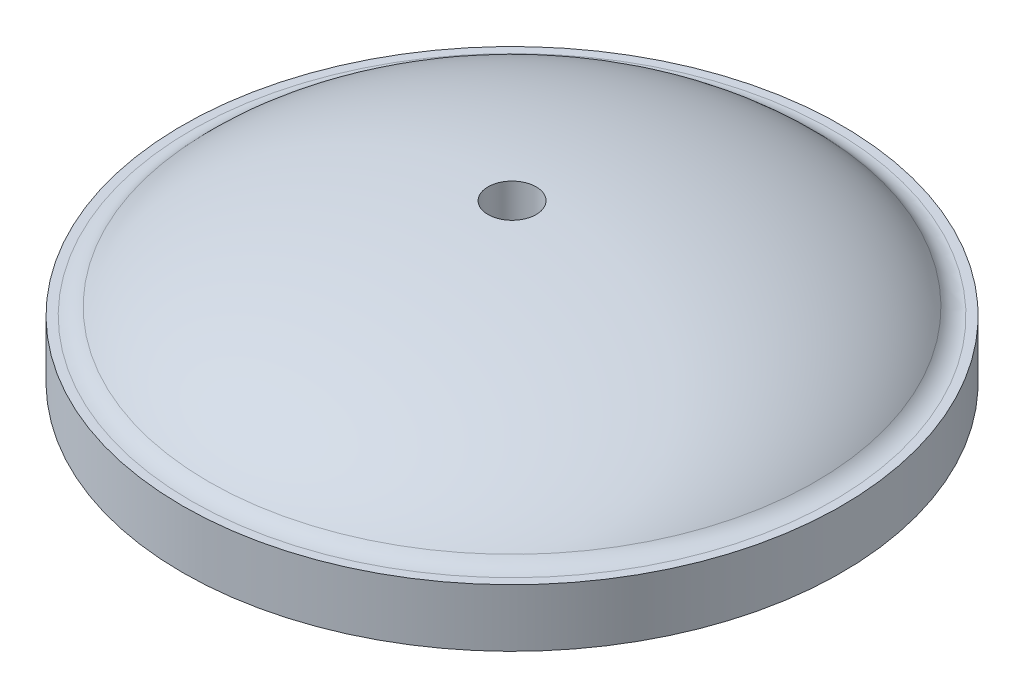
ISO-10303-21;
HEADER;
FILE_DESCRIPTION(('STEP AP214'),'2;1');
FILE_NAME('part.step','',(''),(''),'','','');
FILE_SCHEMA(('AUTOMOTIVE_DESIGN { 1 0 10303 214 1 1 1 1 }'));
ENDSEC;
DATA;
#1=APPLICATION_CONTEXT('core data for automotive mechanical design processes');
#2=APPLICATION_PROTOCOL_DEFINITION('international standard','automotive_design',2000,#1);
#3=PRODUCT_CONTEXT('',#1,'mechanical');
#4=PRODUCT('Part','Part','',(#3));
#5=PRODUCT_RELATED_PRODUCT_CATEGORY('part','',(#4));
#6=PRODUCT_DEFINITION_FORMATION('','',#4);
#7=PRODUCT_DEFINITION_CONTEXT('part definition',#1,'design');
#8=PRODUCT_DEFINITION('design','',#6,#7);
#9=PRODUCT_DEFINITION_SHAPE('','',#8);
#10=(LENGTH_UNIT() NAMED_UNIT(*) SI_UNIT(.MILLI.,.METRE.));
#11=(NAMED_UNIT(*) PLANE_ANGLE_UNIT() SI_UNIT($,.RADIAN.));
#12=(NAMED_UNIT(*) SI_UNIT($,.STERADIAN.) SOLID_ANGLE_UNIT());
#13=UNCERTAINTY_MEASURE_WITH_UNIT(LENGTH_MEASURE(1.E-05),#10,'distance_accuracy_value','');
#14=(GEOMETRIC_REPRESENTATION_CONTEXT(3) GLOBAL_UNCERTAINTY_ASSIGNED_CONTEXT((#13)) GLOBAL_UNIT_ASSIGNED_CONTEXT((#10,
#11,#12)) REPRESENTATION_CONTEXT('',''));
#15=CARTESIAN_POINT('',(0.,0.,0.));
#16=DIRECTION('',(0.,0.,1.));
#17=DIRECTION('',(1.,0.,0.));
#18=AXIS2_PLACEMENT_3D('',#15,#16,#17);
#19=CARTESIAN_POINT('',(0.,86.36,0.));
#20=DIRECTION('',(0.,1.,0.));
#21=DIRECTION('',(0.,0.,1.));
#22=AXIS2_PLACEMENT_3D('',#19,#20,#21);
#23=CYLINDRICAL_SURFACE('',#22,13.3350000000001);
#24=CARTESIAN_POINT('',(0.,22.4242455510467,0.));
#25=DIRECTION('',(0.,1.,0.));
#26=DIRECTION('',(0.,0.,1.));
#27=AXIS2_PLACEMENT_3D('',#24,#25,#26);
#28=CIRCLE('',#27,13.3350000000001);
#29=CARTESIAN_POINT('',(13.2958289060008,22.4242455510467,-1.02135140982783));
#30=VERTEX_POINT('',#29);
#31=CARTESIAN_POINT('',(11.3568868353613,22.4242455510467,-6.98880150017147));
#32=VERTEX_POINT('',#31);
#33=EDGE_CURVE('E219',#30,#32,#28,.T.);
#34=ORIENTED_EDGE('',*,*,#33,.F.);
#35=DIRECTION('',(0.,-1.,0.));
#36=VECTOR('',#35,1.);
#37=CARTESIAN_POINT('',(13.2958289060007,87.9039305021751,-1.02135140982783));
#38=LINE('',#37,#36);
#39=CARTESIAN_POINT('',(13.2958289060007,5.99440000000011,-1.02135140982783));
#40=VERTEX_POINT('',#39);
#41=EDGE_CURVE('E218',#30,#40,#38,.T.);
#42=ORIENTED_EDGE('',*,*,#41,.T.);
#43=CARTESIAN_POINT('',(0.,5.99440000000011,0.));
#44=DIRECTION('',(0.,1.,0.));
#45=DIRECTION('',(0.,0.,1.));
#46=AXIS2_PLACEMENT_3D('',#43,#44,#45);
#47=CIRCLE('',#46,13.335);
#48=CARTESIAN_POINT('',(11.3568868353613,5.99440000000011,-6.98880150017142));
#49=VERTEX_POINT('',#48);
#50=EDGE_CURVE('E45',#40,#49,#47,.T.);
#51=ORIENTED_EDGE('',*,*,#50,.T.);
#52=DIRECTION('',(0.,-1.,0.));
#53=VECTOR('',#52,1.);
#54=CARTESIAN_POINT('',(11.3568868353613,91.1485700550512,-6.98880150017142));
#55=LINE('',#54,#53);
#56=EDGE_CURVE('E625',#32,#49,#55,.T.);
#57=ORIENTED_EDGE('',*,*,#56,.F.);
#58=EDGE_LOOP('',(#34,#42,#51,#57));
#59=FACE_BOUND('',#58,.T.);
#60=ADVANCED_FACE('F36',(#59),#23,.T.);
#61=CARTESIAN_POINT('',(58.8,22.4242455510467,0.));
#62=DIRECTION('',(0.,1.,0.));
#63=DIRECTION('',(0.,0.,1.));
#64=AXIS2_PLACEMENT_3D('',#61,#62,#63);
#65=PLANE('',#64);
#66=CARTESIAN_POINT('',(0.,22.4242455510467,0.));
#67=DIRECTION('',(0.,1.,0.));
#68=DIRECTION('',(0.,0.,1.));
#69=AXIS2_PLACEMENT_3D('',#66,#67,#68);
#70=CIRCLE('',#69,58.8);
#71=CARTESIAN_POINT('',(57.2828366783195,22.4242455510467,13.2708937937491));
#72=VERTEX_POINT('',#71);
#73=CARTESIAN_POINT('',(38.5423527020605,22.4242455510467,-44.4063852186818));
#74=VERTEX_POINT('',#73);
#75=EDGE_CURVE('E509',#72,#74,#70,.T.);
#76=ORIENTED_EDGE('',*,*,#75,.F.);
#77=DIRECTION('',(0.95105651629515,0.,0.309016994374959));
#78=VECTOR('',#77,1.);
#79=CARTESIAN_POINT('',(69.3984983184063,22.4242455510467,17.2075108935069));
#80=LINE('',#79,#78);
#81=EDGE_CURVE('E53',#30,#72,#80,.T.);
#82=ORIENTED_EDGE('',*,*,#81,.F.);
#83=ORIENTED_EDGE('',*,*,#33,.T.);
#84=DIRECTION('',(-0.58778525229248,0.,0.809016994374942));
#85=VECTOR('',#84,1.);
#86=CARTESIAN_POINT('',(46.0302433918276,22.4242455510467,-54.7125825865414));
#87=LINE('',#86,#85);
#88=EDGE_CURVE('E622',#74,#32,#87,.T.);
#89=ORIENTED_EDGE('',*,*,#88,.F.);
#90=EDGE_LOOP('',(#76,#82,#83,#89));
#91=FACE_BOUND('',#90,.T.);
#92=ADVANCED_FACE('F443',(#91),#65,.F.);
#93=CARTESIAN_POINT('',(0.,9.72424555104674,0.));
#94=DIRECTION('',(0.,1.,0.));
#95=DIRECTION('',(0.,0.,1.));
#96=AXIS2_PLACEMENT_3D('',#93,#94,#95);
#97=TOROIDAL_SURFACE('',#96,58.8,12.7);
#98=CARTESIAN_POINT('',(0.,9.72424555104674,0.));
#99=DIRECTION('',(0.,1.,0.));
#100=DIRECTION('',(0.,0.,1.));
#101=AXIS2_PLACEMENT_3D('',#98,#99,#100);
#102=CIRCLE('',#101,71.5);
#103=CARTESIAN_POINT('',(69.3984983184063,9.72424555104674,17.2075108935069));
#104=VERTEX_POINT('',#103);
#105=CARTESIAN_POINT('',(46.0302433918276,9.72424555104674,-54.7125825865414));
#106=VERTEX_POINT('',#105);
#107=EDGE_CURVE('E521',#104,#106,#102,.T.);
#108=ORIENTED_EDGE('',*,*,#107,.F.);
#109=CARTESIAN_POINT('',(69.3984983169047,9.72404555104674,17.207510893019));
#110=CARTESIAN_POINT('',(69.3985406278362,10.0805449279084,17.207524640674));
#111=CARTESIAN_POINT('',(69.3841982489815,10.4370387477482,17.2028645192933));
#112=CARTESIAN_POINT('',(69.3270111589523,11.14747211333,17.1842833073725));
#113=CARTESIAN_POINT('',(69.2841679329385,11.5014117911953,17.1703626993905));
#114=CARTESIAN_POINT('',(69.1702897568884,12.2039623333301,17.1333614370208));
#115=CARTESIAN_POINT('',(69.0992764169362,12.552577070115,17.110287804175));
#116=CARTESIAN_POINT('',(68.9295811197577,13.2422754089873,17.0551504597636));
#117=CARTESIAN_POINT('',(68.8308994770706,13.5833590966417,17.023086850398));
#118=CARTESIAN_POINT('',(68.6065231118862,14.2557295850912,16.9501825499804));
#119=CARTESIAN_POINT('',(68.4808162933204,14.5870119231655,16.9093379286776));
#120=CARTESIAN_POINT('',(68.2033198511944,15.2372707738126,16.8191738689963));
#121=CARTESIAN_POINT('',(68.0515301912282,15.5562472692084,16.7698544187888));
#122=CARTESIAN_POINT('',(67.7229873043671,16.1795789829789,16.6631043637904));
#123=CARTESIAN_POINT('',(67.5462386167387,16.4839368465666,16.6056752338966));
#124=CARTESIAN_POINT('',(67.1690239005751,17.0759426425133,16.4831107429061));
#125=CARTESIAN_POINT('',(66.9685579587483,17.3635906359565,16.4179754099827));
#126=CARTESIAN_POINT('',(66.5451280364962,17.9204324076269,16.2803946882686));
#127=CARTESIAN_POINT('',(66.3221415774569,18.1896072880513,16.2079419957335));
#128=CARTESIAN_POINT('',(65.855433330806,18.7072899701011,16.0562992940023));
#129=CARTESIAN_POINT('',(65.6117115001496,18.9557977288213,15.9771092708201));
#130=CARTESIAN_POINT('',(65.105232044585,19.430439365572,15.8125441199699));
#131=CARTESIAN_POINT('',(64.8424714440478,19.6565697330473,15.7271680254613));
#132=CARTESIAN_POINT('',(64.2998191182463,20.0848311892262,15.5508495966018));
#133=CARTESIAN_POINT('',(64.0199273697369,20.286962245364,15.4599072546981));
#134=CARTESIAN_POINT('',(63.4443113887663,20.6662713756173,15.2728782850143));
#135=CARTESIAN_POINT('',(63.1485508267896,20.843388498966,15.1767798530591));
#136=CARTESIAN_POINT('',(62.543919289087,21.1708596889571,14.9803231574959));
#137=CARTESIAN_POINT('',(62.2350482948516,21.3212137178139,14.8799648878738));
#138=CARTESIAN_POINT('',(61.606405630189,21.5941095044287,14.6757065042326));
#139=CARTESIAN_POINT('',(61.2866345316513,21.7166527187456,14.5718065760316));
#140=CARTESIAN_POINT('',(60.6384407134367,21.9330931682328,14.3611956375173));
#141=CARTESIAN_POINT('',(60.3100179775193,22.0269903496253,14.254484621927));
#142=CARTESIAN_POINT('',(59.6458337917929,22.1857377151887,14.0386780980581));
#143=CARTESIAN_POINT('',(59.3100530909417,22.2504988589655,13.9295763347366));
#144=CARTESIAN_POINT('',(58.6345030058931,22.3501154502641,13.7100768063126));
#145=CARTESIAN_POINT('',(58.2947336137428,22.3849708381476,13.5996790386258));
#146=CARTESIAN_POINT('',(57.6135987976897,22.4245464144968,13.3783649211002));
#147=CARTESIAN_POINT('',(57.2722333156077,22.4292654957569,13.2674485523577));
#148=CARTESIAN_POINT('',(56.5903312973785,22.4085452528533,13.0458851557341));
#149=CARTESIAN_POINT('',(56.2497947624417,22.3831058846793,12.9352381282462));
#150=CARTESIAN_POINT('',(55.5710705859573,22.3021515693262,12.7147072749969));
#151=CARTESIAN_POINT('',(55.2328913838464,22.2465583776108,12.6048261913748));
#152=CARTESIAN_POINT('',(54.5621820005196,22.1056437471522,12.3868995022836));
#153=CARTESIAN_POINT('',(54.2296518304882,22.0203222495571,12.2788539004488));
#154=CARTESIAN_POINT('',(53.5725983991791,21.8205543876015,12.065364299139));
#155=CARTESIAN_POINT('',(53.2480751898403,21.706107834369,11.9599203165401));
#156=CARTESIAN_POINT('',(52.6093435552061,21.4488954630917,11.7523838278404));
#157=CARTESIAN_POINT('',(52.2951351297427,21.3061296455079,11.650291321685));
#158=CARTESIAN_POINT('',(51.678995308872,20.9931406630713,11.4500953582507));
#159=CARTESIAN_POINT('',(51.3770750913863,20.8228931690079,11.3519955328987));
#160=CARTESIAN_POINT('',(50.7879676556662,20.4562261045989,11.1605829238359));
#161=CARTESIAN_POINT('',(50.5007804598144,20.259806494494,11.0672701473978));
#162=CARTESIAN_POINT('',(49.9432160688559,19.8421849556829,10.8861064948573));
#163=CARTESIAN_POINT('',(49.6728380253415,19.620984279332,10.7982553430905));
#164=CARTESIAN_POINT('',(49.1508283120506,19.1553486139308,10.6286441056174));
#165=CARTESIAN_POINT('',(48.8991965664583,18.9109137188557,10.546883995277));
#166=CARTESIAN_POINT('',(48.4170437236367,18.4011021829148,10.3902230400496));
#167=CARTESIAN_POINT('',(48.1864768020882,18.1357734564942,10.3153073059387));
#168=CARTESIAN_POINT('',(47.7474988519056,17.5855677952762,10.1726747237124));
#169=CARTESIAN_POINT('',(47.5390879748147,17.3006907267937,10.1049579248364));
#170=CARTESIAN_POINT('',(47.1458894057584,16.7133140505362,9.97719996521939));
#171=CARTESIAN_POINT('',(46.9611091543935,16.4108089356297,9.91716122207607));
#172=CARTESIAN_POINT('',(46.6166191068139,15.7904202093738,9.80522962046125));
#173=CARTESIAN_POINT('',(46.4569084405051,15.4725371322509,9.75333647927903));
#174=CARTESIAN_POINT('',(46.1643594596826,14.8250329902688,9.65828155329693));
#175=CARTESIAN_POINT('',(46.031410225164,14.4954673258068,9.61508372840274));
#176=CARTESIAN_POINT('',(45.7925294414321,13.8256829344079,9.53746665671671));
#177=CARTESIAN_POINT('',(45.6865975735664,13.4854643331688,9.50304730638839));
#178=CARTESIAN_POINT('',(45.502664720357,12.797277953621,9.44328389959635));
#179=CARTESIAN_POINT('',(45.4246267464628,12.449321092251,9.41792782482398));
#180=CARTESIAN_POINT('',(45.2968992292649,11.7478457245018,9.37642663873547));
#181=CARTESIAN_POINT('',(45.2471954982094,11.3943300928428,9.36027691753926));
#182=CARTESIAN_POINT('',(45.1900487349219,10.8206946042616,9.3417088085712));
#183=CARTESIAN_POINT('',(45.1737056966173,10.6015130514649,9.33639863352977));
#184=CARTESIAN_POINT('',(45.1519383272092,10.1629106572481,9.32932598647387));
#185=CARTESIAN_POINT('',(45.1464961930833,9.94349079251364,9.32755772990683));
#186=CARTESIAN_POINT('',(45.1465018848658,9.72404555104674,9.32755957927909));
#187=B_SPLINE_CURVE_WITH_KNOTS('',3,(#109,#110,#111,#112,#113,#114,#115,#116,#117,#118,#119,
#120,#121,#122,#123,#124,#125,#126,#127,#128,#129,#130,#131,#132,#133,#134,#135,#136,#137,#138,
#139,#140,#141,#142,#143,#144,#145,#146,#147,#148,#149,#150,#151,#152,#153,#154,#155,#156,#157,
#158,#159,#160,#161,#162,#163,#164,#165,#166,#167,#168,#169,#170,#171,#172,#173,#174,#175,#176,
#177,#178,#179,#180,#181,#182,#183,#184,#185,#186),.UNSPECIFIED.,.F.,.F.,(4,2,2,2,2,2,2,2,2,2,2,
2,2,2,2,2,2,2,2,2,2,2,2,2,2,2,2,2,2,2,2,2,2,2,2,2,2,2,4),(0.,1.06917084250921,2.13828597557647,
3.20658254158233,4.27486696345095,5.34363053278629,6.41239559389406,7.4809665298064,
8.54953355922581,9.61917791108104,10.688824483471,11.7586385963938,12.8284541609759,
13.9008331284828,14.9732136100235,16.0455379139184,17.1178642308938,18.193445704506,
19.2690293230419,20.3446524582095,21.4202771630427,22.4987063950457,23.5771377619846,
24.6555761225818,25.7340144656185,26.8134128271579,27.8928128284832,28.9721583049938,
30.0514994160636,31.1284336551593,32.2053752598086,33.2826551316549,34.3598976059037,
35.4325788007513,36.505247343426,37.5764881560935,38.6471920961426,39.306480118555,
39.9646905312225),.UNSPECIFIED.);
#188=EDGE_CURVE('E250',#104,#72,#187,.T.);
#189=ORIENTED_EDGE('',*,*,#188,.T.);
#190=ORIENTED_EDGE('',*,*,#75,.T.);
#191=CARTESIAN_POINT('',(31.0416853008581,9.72404555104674,-34.0826022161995));
#192=CARTESIAN_POINT('',(31.0416583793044,10.0797793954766,-34.0825651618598));
#193=CARTESIAN_POINT('',(31.0505168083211,10.4355069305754,-34.0947577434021));
#194=CARTESIAN_POINT('',(31.0858334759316,11.144402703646,-34.1433669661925));
#195=CARTESIAN_POINT('',(31.1122906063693,11.4975711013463,-34.1797820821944));
#196=CARTESIAN_POINT('',(31.1826022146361,12.1985322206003,-34.2765577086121));
#197=CARTESIAN_POINT('',(31.2264410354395,12.5463294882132,-34.3368966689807));
#198=CARTESIAN_POINT('',(31.3311829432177,13.2344009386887,-34.4810615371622));
#199=CARTESIAN_POINT('',(31.3920858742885,13.5746751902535,-34.5648872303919));
#200=CARTESIAN_POINT('',(31.5305351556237,14.2454264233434,-34.7554463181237));
#201=CARTESIAN_POINT('',(31.6080879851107,14.5758995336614,-34.8621886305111));
#202=CARTESIAN_POINT('',(31.7792526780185,15.2245810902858,-35.0977766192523));
#203=CARTESIAN_POINT('',(31.8728646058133,15.5427894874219,-35.2266223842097));
#204=CARTESIAN_POINT('',(32.0754494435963,16.1646632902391,-35.5054564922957));
#205=CARTESIAN_POINT('',(32.1844201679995,16.4683307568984,-35.6554418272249));
#206=CARTESIAN_POINT('',(32.4169424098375,17.0590509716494,-35.9754812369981));
#207=CARTESIAN_POINT('',(32.5404939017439,17.3461037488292,-36.1455352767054));
#208=CARTESIAN_POINT('',(32.8016931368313,17.9024625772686,-36.5050451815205));
#209=CARTESIAN_POINT('',(32.9393833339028,18.1717109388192,-36.6945594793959));
#210=CARTESIAN_POINT('',(33.2275514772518,18.6896125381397,-37.0911889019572));
#211=CARTESIAN_POINT('',(33.3780294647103,18.9382657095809,-37.298304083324));
#212=CARTESIAN_POINT('',(33.690724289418,19.4132925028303,-37.7286915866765));
#213=CARTESIAN_POINT('',(33.8529430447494,19.6396624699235,-37.9519665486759));
#214=CARTESIAN_POINT('',(34.1879461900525,20.0685127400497,-38.4130588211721));
#215=CARTESIAN_POINT('',(34.360730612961,20.2709929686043,-38.6508761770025));
#216=CARTESIAN_POINT('',(34.7165907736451,20.6516787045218,-39.140675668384));
#217=CARTESIAN_POINT('',(34.89971641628,20.8297491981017,-39.3927264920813));
#218=CARTESIAN_POINT('',(35.2741118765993,21.1590933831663,-39.9080376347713));
#219=CARTESIAN_POINT('',(35.4653817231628,21.3103669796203,-40.1712979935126));
#220=CARTESIAN_POINT('',(35.8547015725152,21.5850564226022,-40.7071507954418));
#221=CARTESIAN_POINT('',(36.0527512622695,21.7084735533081,-40.9797428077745));
#222=CARTESIAN_POINT('',(36.4542396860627,21.9265968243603,-41.5323442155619));
#223=CARTESIAN_POINT('',(36.6576784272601,22.0213029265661,-41.8123536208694));
#224=CARTESIAN_POINT('',(37.069200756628,22.1816083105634,-42.3787655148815));
#225=CARTESIAN_POINT('',(37.2772976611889,22.247108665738,-42.6651863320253));
#226=CARTESIAN_POINT('',(37.6959945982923,22.3480678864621,-43.2414732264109));
#227=CARTESIAN_POINT('',(37.9065946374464,22.3835266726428,-43.5313393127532));
#228=CARTESIAN_POINT('',(38.3288079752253,22.4241438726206,-44.1124661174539));
#229=CARTESIAN_POINT('',(38.5404213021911,22.4293014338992,-44.4037268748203));
#230=CARTESIAN_POINT('',(38.9631510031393,22.4092653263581,-44.9855643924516));
#231=CARTESIAN_POINT('',(39.1742673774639,22.3840716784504,-45.2761411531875));
#232=CARTESIAN_POINT('',(39.594548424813,22.3034876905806,-45.8546083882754));
#233=CARTESIAN_POINT('',(39.8037126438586,22.2480904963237,-46.1424982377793));
#234=CARTESIAN_POINT('',(40.2185486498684,22.1074711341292,-46.7134710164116));
#235=CARTESIAN_POINT('',(40.424220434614,22.0222489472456,-46.9965539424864));
#236=CARTESIAN_POINT('',(40.8305991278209,21.8225682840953,-47.5558862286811));
#237=CARTESIAN_POINT('',(41.0313060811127,21.7081100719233,-47.8321356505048));
#238=CARTESIAN_POINT('',(41.4263184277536,21.4507535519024,-48.3758235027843));
#239=CARTESIAN_POINT('',(41.6206238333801,21.3078552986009,-48.6432619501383));
#240=CARTESIAN_POINT('',(42.0010458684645,20.9949417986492,-49.1668679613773));
#241=CARTESIAN_POINT('',(42.1871784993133,20.8249828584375,-49.4230575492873));
#242=CARTESIAN_POINT('',(42.5503433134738,20.4589308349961,-49.9229110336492));
#243=CARTESIAN_POINT('',(42.7273755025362,20.2628377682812,-50.166574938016));
#244=CARTESIAN_POINT('',(43.0710560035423,19.8459119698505,-50.6396105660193));
#245=CARTESIAN_POINT('',(43.2377049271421,19.6250806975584,-50.8689831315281));
#246=CARTESIAN_POINT('',(43.5594283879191,19.1602325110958,-51.3117974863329));
#247=CARTESIAN_POINT('',(43.7145029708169,18.9162156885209,-51.5252393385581));
#248=CARTESIAN_POINT('',(44.0114903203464,18.407529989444,-51.9340073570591));
#249=CARTESIAN_POINT('',(44.1534428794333,18.1429283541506,-52.1293882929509));
#250=CARTESIAN_POINT('',(44.4237124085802,17.5942793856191,-52.501382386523));
#251=CARTESIAN_POINT('',(44.5520293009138,17.3102319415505,-52.677995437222));
#252=CARTESIAN_POINT('',(44.7941393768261,16.7246178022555,-53.0112313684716));
#253=CARTESIAN_POINT('',(44.9079279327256,16.4230455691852,-53.1678478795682));
#254=CARTESIAN_POINT('',(45.1201074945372,15.8046226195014,-53.4598879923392));
#255=CARTESIAN_POINT('',(45.2184989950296,15.4877723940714,-53.5953122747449));
#256=CARTESIAN_POINT('',(45.3989832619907,14.8417395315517,-53.8437275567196));
#257=CARTESIAN_POINT('',(45.4811103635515,14.5125846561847,-53.9567658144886));
#258=CARTESIAN_POINT('',(45.6287340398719,13.8436519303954,-54.1599523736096));
#259=CARTESIAN_POINT('',(45.6942307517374,13.5038741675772,-54.2501008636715));
#260=CARTESIAN_POINT('',(45.8080467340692,12.8165756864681,-54.4067551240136));
#261=CARTESIAN_POINT('',(45.8563881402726,12.4690655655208,-54.4732913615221));
#262=CARTESIAN_POINT('',(45.9356447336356,11.7684829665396,-54.5823787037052));
#263=CARTESIAN_POINT('',(45.9665684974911,11.4154133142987,-54.6249416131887));
#264=CARTESIAN_POINT('',(46.0025387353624,10.8386531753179,-54.6744503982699));
#265=CARTESIAN_POINT('',(46.012936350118,10.6158891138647,-54.6887614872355));
#266=CARTESIAN_POINT('',(46.0267847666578,10.1701062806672,-54.7078221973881));
#267=CARTESIAN_POINT('',(46.0302470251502,9.9470885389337,-54.712587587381));
#268=CARTESIAN_POINT('',(46.0302433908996,9.72404555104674,-54.7125825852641));
#269=B_SPLINE_CURVE_WITH_KNOTS('',3,(#191,#192,#193,#194,#195,#196,#197,#198,#199,#200,#201,
#202,#203,#204,#205,#206,#207,#208,#209,#210,#211,#212,#213,#214,#215,#216,#217,#218,#219,#220,
#221,#222,#223,#224,#225,#226,#227,#228,#229,#230,#231,#232,#233,#234,#235,#236,#237,#238,#239,
#240,#241,#242,#243,#244,#245,#246,#247,#248,#249,#250,#251,#252,#253,#254,#255,#256,#257,#258,
#259,#260,#261,#262,#263,#264,#265,#266,#267,#268),.UNSPECIFIED.,.F.,.F.,(4,2,2,2,2,2,2,2,2,2,2,
2,2,2,2,2,2,2,2,2,2,2,2,2,2,2,2,2,2,2,2,2,2,2,2,2,2,2,4),(0.,1.06687276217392,2.13367835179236,
3.19952516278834,4.26536223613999,5.33161482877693,6.3978716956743,7.463976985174,
8.53008040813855,9.59948418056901,10.6688913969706,11.7384737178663,12.8080593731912,
13.883340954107,14.9586263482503,16.0338621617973,17.1090994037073,18.1879515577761,
19.2668065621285,20.3456919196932,21.4245765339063,22.5037060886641,23.5828363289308,
24.6619568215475,25.7410752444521,26.8179769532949,27.8948779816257,28.9717155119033,
30.0485487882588,31.122001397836,32.1954601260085,33.2692599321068,34.343025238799,
35.4144990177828,36.4859639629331,37.5560413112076,38.6255912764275,39.2956998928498,
39.9647006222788),.UNSPECIFIED.);
#270=EDGE_CURVE('E278',#74,#106,#269,.T.);
#271=ORIENTED_EDGE('',*,*,#270,.T.);
#272=EDGE_LOOP('',(#108,#189,#190,#271));
#273=FACE_BOUND('',#272,.T.);
#274=ADVANCED_FACE('F432',(#273),#97,.F.);
#275=CARTESIAN_POINT('',(0.,86.36,0.));
#276=DIRECTION('',(0.,1.,0.));
#277=DIRECTION('',(0.,0.,1.));
#278=AXIS2_PLACEMENT_3D('',#275,#276,#277);
#279=CYLINDRICAL_SURFACE('',#278,71.5);
#280=CARTESIAN_POINT('',(0.,5.99440000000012,0.));
#281=DIRECTION('',(0.,1.,0.));
#282=DIRECTION('',(0.,0.,1.));
#283=AXIS2_PLACEMENT_3D('',#280,#281,#282);
#284=CIRCLE('',#283,71.5);
#285=CARTESIAN_POINT('',(69.3984983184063,5.99440000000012,17.2075108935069));
#286=VERTEX_POINT('',#285);
#287=CARTESIAN_POINT('',(46.0302433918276,5.99440000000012,-54.7125825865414));
#288=VERTEX_POINT('',#287);
#289=EDGE_CURVE('E533',#286,#288,#284,.T.);
#290=ORIENTED_EDGE('',*,*,#289,.F.);
#291=DIRECTION('',(0.,-1.,0.));
#292=VECTOR('',#291,1.);
#293=CARTESIAN_POINT('',(69.3984983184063,87.9039305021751,17.2075108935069));
#294=LINE('',#293,#292);
#295=EDGE_CURVE('E226',#104,#286,#294,.T.);
#296=ORIENTED_EDGE('',*,*,#295,.F.);
#297=ORIENTED_EDGE('',*,*,#107,.T.);
#298=DIRECTION('',(0.,-1.,0.));
#299=VECTOR('',#298,1.);
#300=CARTESIAN_POINT('',(46.0302433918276,91.1485700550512,-54.7125825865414));
#301=LINE('',#300,#299);
#302=EDGE_CURVE('E626',#106,#288,#301,.T.);
#303=ORIENTED_EDGE('',*,*,#302,.T.);
#304=EDGE_LOOP('',(#290,#296,#297,#303));
#305=FACE_BOUND('',#304,.T.);
#306=ADVANCED_FACE('F425',(#305),#279,.F.);
#307=CARTESIAN_POINT('',(3.13727417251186,22.4242455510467,-12.9606996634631));
#308=VERTEX_POINT('',#307);
#309=CARTESIAN_POINT('',(-3.1372741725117,22.4242455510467,-12.9606996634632));
#310=VERTEX_POINT('',#309);
#311=EDGE_CURVE('E490',#308,#310,#28,.T.);
#312=ORIENTED_EDGE('',*,*,#311,.F.);
#313=DIRECTION('',(0.,-1.,0.));
#314=VECTOR('',#313,1.);
#315=CARTESIAN_POINT('',(3.13727417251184,91.1485700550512,-12.960699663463));
#316=LINE('',#315,#314);
#317=CARTESIAN_POINT('',(3.13727417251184,5.99440000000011,-12.960699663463));
#318=VERTEX_POINT('',#317);
#319=EDGE_CURVE('E286',#308,#318,#316,.T.);
#320=ORIENTED_EDGE('',*,*,#319,.T.);
#321=CARTESIAN_POINT('',(-3.13727417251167,5.99440000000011,-12.9606996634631));
#322=VERTEX_POINT('',#321);
#323=EDGE_CURVE('E216',#318,#322,#47,.T.);
#324=ORIENTED_EDGE('',*,*,#323,.T.);
#325=DIRECTION('',(0.,-1.,0.));
#326=VECTOR('',#325,1.);
#327=CARTESIAN_POINT('',(-3.13727417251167,91.1485700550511,-12.9606996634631));
#328=LINE('',#327,#326);
#329=EDGE_CURVE('E305',#310,#322,#328,.T.);
#330=ORIENTED_EDGE('',*,*,#329,.F.);
#331=EDGE_LOOP('',(#312,#320,#324,#330));
#332=FACE_BOUND('',#331,.T.);
#333=ADVANCED_FACE('F436',(#332),#23,.T.);
#334=CARTESIAN_POINT('',(30.3227400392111,22.4242455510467,-50.3782833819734));
#335=VERTEX_POINT('',#334);
#336=CARTESIAN_POINT('',(-30.3227400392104,22.4242455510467,-50.3782833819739));
#337=VERTEX_POINT('',#336);
#338=EDGE_CURVE('E514',#335,#337,#70,.T.);
#339=ORIENTED_EDGE('',*,*,#338,.F.);
#340=DIRECTION('',(0.587785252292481,0.,-0.809016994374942));
#341=VECTOR('',#340,1.);
#342=CARTESIAN_POINT('',(37.8106307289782,22.4242455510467,-60.684480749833));
#343=LINE('',#342,#341);
#344=EDGE_CURVE('E617',#308,#335,#343,.T.);
#345=ORIENTED_EDGE('',*,*,#344,.F.);
#346=ORIENTED_EDGE('',*,*,#311,.T.);
#347=DIRECTION('',(0.587785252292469,0.,0.809016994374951));
#348=VECTOR('',#347,1.);
#349=CARTESIAN_POINT('',(-37.8106307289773,22.4242455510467,-60.6844807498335));
#350=LINE('',#349,#348);
#351=EDGE_CURVE('E302',#337,#310,#350,.T.);
#352=ORIENTED_EDGE('',*,*,#351,.F.);
#353=EDGE_LOOP('',(#339,#345,#346,#352));
#354=FACE_BOUND('',#353,.T.);
#355=ADVANCED_FACE('F448',(#354),#65,.F.);
#356=CARTESIAN_POINT('',(37.8106307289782,9.72424555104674,-60.684480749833));
#357=VERTEX_POINT('',#356);
#358=CARTESIAN_POINT('',(-37.8106307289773,9.72424555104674,-60.6844807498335));
#359=VERTEX_POINT('',#358);
#360=EDGE_CURVE('E526',#357,#359,#102,.T.);
#361=ORIENTED_EDGE('',*,*,#360,.F.);
#362=CARTESIAN_POINT('',(37.8106307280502,9.72404555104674,-60.6844807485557));
#363=CARTESIAN_POINT('',(37.8106568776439,10.0805449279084,-60.6845167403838));
#364=CARTESIAN_POINT('',(37.8017928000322,10.4370387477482,-60.6723163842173));
#365=CARTESIAN_POINT('',(37.7664492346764,11.14747211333,-60.6236701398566));
#366=CARTESIAN_POINT('',(37.7399706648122,11.5014117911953,-60.5872255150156));
#367=CARTESIAN_POINT('',(37.6695900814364,12.2039623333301,-60.490354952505));
#368=CARTESIAN_POINT('',(37.6257014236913,12.552577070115,-60.4299473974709));
#369=CARTESIAN_POINT('',(37.5208239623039,13.2422754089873,-60.2855959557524));
#370=CARTESIAN_POINT('',(37.4598353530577,13.5833590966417,-60.2016523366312));
#371=CARTESIAN_POINT('',(37.3211631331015,14.2557295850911,-60.0107864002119));
#372=CARTESIAN_POINT('',(37.2434720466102,14.5870119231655,-59.9038537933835));
#373=CARTESIAN_POINT('',(37.0719698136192,15.2372707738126,-59.6678012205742));
#374=CARTESIAN_POINT('',(36.9781586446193,15.5562472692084,-59.5386812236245));
#375=CARTESIAN_POINT('',(36.7751079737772,16.1795789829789,-59.2592059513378));
#376=CARTESIAN_POINT('',(36.6658712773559,16.4839368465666,-59.1088545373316));
#377=CARTESIAN_POINT('',(36.4327397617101,17.0759426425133,-58.7879765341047));
#378=CARTESIAN_POINT('',(36.3088449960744,17.3635906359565,-58.6174500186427));
#379=CARTESIAN_POINT('',(36.0471509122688,17.9204324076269,-58.2572590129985));
#380=CARTESIAN_POINT('',(35.9093377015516,18.1896072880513,-58.0675754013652));
#381=CARTESIAN_POINT('',(35.6208961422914,18.7072899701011,-57.670569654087));
#382=CARTESIAN_POINT('',(35.4702677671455,18.9557977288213,-57.4632474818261));
#383=CARTESIAN_POINT('',(35.157246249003,19.430439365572,-57.0324103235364));
#384=CARTESIAN_POINT('',(34.9948512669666,19.6565697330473,-56.8088928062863));
#385=CARTESIAN_POINT('',(34.6594736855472,20.0848311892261,-56.3472851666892));
#386=CARTESIAN_POINT('',(34.4864910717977,20.2869622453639,-56.1091950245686));
#387=CARTESIAN_POINT('',(34.1307408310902,20.6662713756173,-55.6195468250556));
#388=CARTESIAN_POINT('',(33.9479507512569,20.843388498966,-55.3679578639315));
#389=CARTESIAN_POINT('',(33.5742679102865,21.1708596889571,-54.8536275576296));
#390=CARTESIAN_POINT('',(33.3833751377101,21.3212137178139,-54.5908861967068));
#391=CARTESIAN_POINT('',(32.9948526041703,21.5941095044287,-54.0561308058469));
#392=CARTESIAN_POINT('',(32.7972231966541,21.7166527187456,-53.7841172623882));
#393=CARTESIAN_POINT('',(32.3966173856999,21.9330931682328,-53.2327306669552));
#394=CARTESIAN_POINT('',(32.1936409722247,22.0269903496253,-52.9533576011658));
#395=CARTESIAN_POINT('',(31.7831525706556,22.1857377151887,-52.388368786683));
#396=CARTESIAN_POINT('',(31.5756286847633,22.2504988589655,-52.102736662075));
#397=CARTESIAN_POINT('',(31.1581157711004,22.3501154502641,-51.5280794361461));
#398=CARTESIAN_POINT('',(30.9481267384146,22.3849708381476,-51.2390543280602));
#399=CARTESIAN_POINT('',(30.5271622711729,22.4245464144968,-50.6596464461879));
#400=CARTESIAN_POINT('',(30.3161868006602,22.4292654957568,-50.3692636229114));
#401=CARTESIAN_POINT('',(29.8947481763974,22.4085452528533,-49.7892031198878));
#402=CARTESIAN_POINT('',(29.6842850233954,22.3831058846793,-49.4995254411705));
#403=CARTESIAN_POINT('',(29.2648104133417,22.3021515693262,-48.9221681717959));
#404=CARTESIAN_POINT('',(29.0558041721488,22.2465583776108,-48.6344957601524));
#405=CARTESIAN_POINT('',(28.6412829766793,22.1056437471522,-48.0639562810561));
#406=CARTESIAN_POINT('',(28.4357680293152,22.0203222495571,-47.7810892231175));
#407=CARTESIAN_POINT('',(28.0296866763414,21.8205543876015,-47.2221661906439));
#408=CARTESIAN_POINT('',(27.8291203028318,21.706107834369,-46.9461102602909));
#409=CARTESIAN_POINT('',(27.4343624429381,21.4488954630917,-46.4027726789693));
#410=CARTESIAN_POINT('',(27.2401709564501,21.3061296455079,-46.1354910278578));
#411=CARTESIAN_POINT('',(26.8593756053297,20.9931406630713,-45.6113711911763));
#412=CARTESIAN_POINT('',(26.6727786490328,20.8228931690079,-45.3545425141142));
#413=CARTESIAN_POINT('',(26.3086902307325,20.4562261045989,-44.8534177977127));
#414=CARTESIAN_POINT('',(26.1311987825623,20.259806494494,-44.6091217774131));
#415=CARTESIAN_POINT('',(25.7866050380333,19.8421849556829,-44.1348291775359));
#416=CARTESIAN_POINT('',(25.6195022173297,19.6209842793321,-43.9048318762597));
#417=CARTESIAN_POINT('',(25.2968824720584,19.1553486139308,-43.4607838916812));
#418=CARTESIAN_POINT('',(25.1413655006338,18.9109137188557,-43.2467331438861));
#419=CARTESIAN_POINT('',(24.8433786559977,18.4011021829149,-42.8365894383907));
#420=CARTESIAN_POINT('',(24.7008804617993,18.1357734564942,-42.6404575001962));
#421=CARTESIAN_POINT('',(24.4295771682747,17.5855677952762,-42.2670405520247));
#422=CARTESIAN_POINT('',(24.3007721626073,17.3006907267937,-42.0897556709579));
#423=CARTESIAN_POINT('',(24.0577620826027,16.7133140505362,-41.7552809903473));
#424=CARTESIAN_POINT('',(23.9435616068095,16.4108089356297,-41.5980975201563));
#425=CARTESIAN_POINT('',(23.7306550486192,15.7904202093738,-41.3050567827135));
#426=CARTESIAN_POINT('',(23.6319484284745,15.4725371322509,-41.1691987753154));
#427=CARTESIAN_POINT('',(23.451143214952,14.8250329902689,-40.9203417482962));
#428=CARTESIAN_POINT('',(23.3689760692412,14.4954673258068,-40.8072483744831));
#429=CARTESIAN_POINT('',(23.2213396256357,13.8256829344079,-40.6040442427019));
#430=CARTESIAN_POINT('',(23.1558701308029,13.4854643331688,-40.5139332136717));
#431=CARTESIAN_POINT('',(23.0421933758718,12.797277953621,-40.3574705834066));
#432=CARTESIAN_POINT('',(22.993963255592,12.449321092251,-40.2910875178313));
#433=CARTESIAN_POINT('',(22.915023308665,11.7478457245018,-40.1824360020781));
#434=CARTESIAN_POINT('',(22.884304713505,11.3943300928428,-40.1401554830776));
#435=CARTESIAN_POINT('',(22.8489860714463,10.8206946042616,-40.0915435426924));
#436=CARTESIAN_POINT('',(22.8388855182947,10.6015130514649,-40.0776413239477));
#437=CARTESIAN_POINT('',(22.8254325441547,10.1629106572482,-40.059124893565));
#438=CARTESIAN_POINT('',(22.8220691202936,9.94349079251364,-40.0544955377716));
#439=CARTESIAN_POINT('',(22.8220726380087,9.72404555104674,-40.0545003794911));
#440=B_SPLINE_CURVE_WITH_KNOTS('',3,(#362,#363,#364,#365,#366,#367,#368,#369,#370,#371,#372,
#373,#374,#375,#376,#377,#378,#379,#380,#381,#382,#383,#384,#385,#386,#387,#388,#389,#390,#391,
#392,#393,#394,#395,#396,#397,#398,#399,#400,#401,#402,#403,#404,#405,#406,#407,#408,#409,#410,
#411,#412,#413,#414,#415,#416,#417,#418,#419,#420,#421,#422,#423,#424,#425,#426,#427,#428,#429,
#430,#431,#432,#433,#434,#435,#436,#437,#438,#439),.UNSPECIFIED.,.F.,.F.,(4,2,2,2,2,2,2,2,2,2,2,
2,2,2,2,2,2,2,2,2,2,2,2,2,2,2,2,2,2,2,2,2,2,2,2,2,2,2,4),(0.,1.06917084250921,2.13828597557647,
3.20658254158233,4.27486696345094,5.34363053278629,6.41239559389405,7.4809665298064,
8.5495335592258,9.61917791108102,10.6888244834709,11.7586385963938,12.8284541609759,
13.9008331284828,14.9732136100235,16.0455379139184,17.1178642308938,18.193445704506,
19.2690293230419,20.3446524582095,21.4202771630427,22.4987063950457,23.5771377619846,
24.6555761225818,25.7340144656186,26.813412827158,27.8928128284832,28.9721583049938,
30.0514994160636,31.1284336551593,32.2053752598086,33.2826551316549,34.3598976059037,
35.4325788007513,36.505247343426,37.5764881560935,38.6471920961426,39.306480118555,
39.9646905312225),.UNSPECIFIED.);
#441=EDGE_CURVE('E285',#357,#335,#440,.T.);
#442=ORIENTED_EDGE('',*,*,#441,.T.);
#443=ORIENTED_EDGE('',*,*,#338,.T.);
#444=CARTESIAN_POINT('',(-22.8220726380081,9.72404555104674,-40.0545003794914));
#445=CARTESIAN_POINT('',(-22.8220457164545,10.0797793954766,-40.0544633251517));
#446=CARTESIAN_POINT('',(-22.8309041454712,10.4355069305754,-40.066655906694));
#447=CARTESIAN_POINT('',(-22.8662208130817,11.144402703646,-40.1152651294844));
#448=CARTESIAN_POINT('',(-22.8926779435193,11.4975711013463,-40.1516802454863));
#449=CARTESIAN_POINT('',(-22.9629895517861,12.1985322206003,-40.248455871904));
#450=CARTESIAN_POINT('',(-23.0068283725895,12.5463294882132,-40.3087948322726));
#451=CARTESIAN_POINT('',(-23.1115702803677,13.2344009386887,-40.4529597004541));
#452=CARTESIAN_POINT('',(-23.1724732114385,13.5746751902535,-40.5367853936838));
#453=CARTESIAN_POINT('',(-23.3109224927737,14.2454264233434,-40.7273444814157));
#454=CARTESIAN_POINT('',(-23.3884753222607,14.5758995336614,-40.8340867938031));
#455=CARTESIAN_POINT('',(-23.5596400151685,15.2245810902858,-41.0696747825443));
#456=CARTESIAN_POINT('',(-23.6532519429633,15.5427894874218,-41.1985205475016));
#457=CARTESIAN_POINT('',(-23.8558367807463,16.1646632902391,-41.4773546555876));
#458=CARTESIAN_POINT('',(-23.9648075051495,16.4683307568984,-41.6273399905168));
#459=CARTESIAN_POINT('',(-24.1973297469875,17.0590509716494,-41.9473794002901));
#460=CARTESIAN_POINT('',(-24.3208812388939,17.3461037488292,-42.1174334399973));
#461=CARTESIAN_POINT('',(-24.5820804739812,17.9024625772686,-42.4769433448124));
#462=CARTESIAN_POINT('',(-24.7197706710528,18.1717109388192,-42.6664576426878));
#463=CARTESIAN_POINT('',(-25.0079388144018,18.6896125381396,-43.0630870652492));
#464=CARTESIAN_POINT('',(-25.1584168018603,18.9382657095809,-43.2702022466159));
#465=CARTESIAN_POINT('',(-25.471111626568,19.4132925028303,-43.7005897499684));
#466=CARTESIAN_POINT('',(-25.6333303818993,19.6396624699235,-43.9238647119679));
#467=CARTESIAN_POINT('',(-25.9683335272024,20.0685127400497,-44.384956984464));
#468=CARTESIAN_POINT('',(-26.141117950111,20.2709929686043,-44.6227743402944));
#469=CARTESIAN_POINT('',(-26.496978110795,20.6516787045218,-45.1125738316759));
#470=CARTESIAN_POINT('',(-26.6801037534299,20.8297491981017,-45.3646246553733));
#471=CARTESIAN_POINT('',(-27.0544992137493,21.1590933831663,-45.8799357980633));
#472=CARTESIAN_POINT('',(-27.2457690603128,21.3103669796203,-46.1431961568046));
#473=CARTESIAN_POINT('',(-27.6350889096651,21.5850564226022,-46.6790489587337));
#474=CARTESIAN_POINT('',(-27.8331385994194,21.7084735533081,-46.9516409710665));
#475=CARTESIAN_POINT('',(-28.2346270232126,21.9265968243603,-47.5042423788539));
#476=CARTESIAN_POINT('',(-28.43806576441,22.0213029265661,-47.7842517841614));
#477=CARTESIAN_POINT('',(-28.8495880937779,22.1816083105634,-48.3506636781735));
#478=CARTESIAN_POINT('',(-29.0576849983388,22.247108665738,-48.6370844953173));
#479=CARTESIAN_POINT('',(-29.4763819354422,22.3480678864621,-49.213371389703));
#480=CARTESIAN_POINT('',(-29.6869819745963,22.3835266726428,-49.5032374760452));
#481=CARTESIAN_POINT('',(-30.1091953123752,22.4241438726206,-50.0843642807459));
#482=CARTESIAN_POINT('',(-30.320808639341,22.4293014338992,-50.3756250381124));
#483=CARTESIAN_POINT('',(-30.7435383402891,22.4092653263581,-50.9574625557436));
#484=CARTESIAN_POINT('',(-30.9546547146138,22.3840716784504,-51.2480393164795));
#485=CARTESIAN_POINT('',(-31.3749357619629,22.3034876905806,-51.8265065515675));
#486=CARTESIAN_POINT('',(-31.5840999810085,22.2480904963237,-52.1143964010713));
#487=CARTESIAN_POINT('',(-31.9989359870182,22.1074711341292,-52.6853691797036));
#488=CARTESIAN_POINT('',(-32.2046077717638,22.0222489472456,-52.9684521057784));
#489=CARTESIAN_POINT('',(-32.6109864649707,21.8225682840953,-53.5277843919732));
#490=CARTESIAN_POINT('',(-32.8116934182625,21.7081100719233,-53.8040338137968));
#491=CARTESIAN_POINT('',(-33.2067057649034,21.4507535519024,-54.3477216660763));
#492=CARTESIAN_POINT('',(-33.4010111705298,21.3078552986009,-54.6151601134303));
#493=CARTESIAN_POINT('',(-33.7814332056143,20.9949417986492,-55.1387661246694));
#494=CARTESIAN_POINT('',(-33.9675658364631,20.8249828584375,-55.3949557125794));
#495=CARTESIAN_POINT('',(-34.3307306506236,20.4589308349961,-55.8948091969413));
#496=CARTESIAN_POINT('',(-34.507762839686,20.2628377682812,-56.1384731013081));
#497=CARTESIAN_POINT('',(-34.851443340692,19.8459119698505,-56.6115087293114));
#498=CARTESIAN_POINT('',(-35.0180922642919,19.6250806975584,-56.8408812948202));
#499=CARTESIAN_POINT('',(-35.3398157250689,19.1602325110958,-57.2836956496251));
#500=CARTESIAN_POINT('',(-35.4948903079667,18.9162156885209,-57.4971375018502));
#501=CARTESIAN_POINT('',(-35.7918776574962,18.407529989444,-57.9059055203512));
#502=CARTESIAN_POINT('',(-35.933830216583,18.1429283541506,-58.101286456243));
#503=CARTESIAN_POINT('',(-36.2040997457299,17.5942793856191,-58.4732805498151));
#504=CARTESIAN_POINT('',(-36.3324166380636,17.3102319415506,-58.6498936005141));
#505=CARTESIAN_POINT('',(-36.5745267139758,16.7246178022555,-58.9831295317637));
#506=CARTESIAN_POINT('',(-36.6883152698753,16.4230455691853,-59.1397460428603));
#507=CARTESIAN_POINT('',(-36.9004948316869,15.8046226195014,-59.4317861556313));
#508=CARTESIAN_POINT('',(-36.9988863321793,15.4877723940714,-59.567210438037));
#509=CARTESIAN_POINT('',(-37.1793705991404,14.8417395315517,-59.8156257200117));
#510=CARTESIAN_POINT('',(-37.2614977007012,14.5125846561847,-59.9286639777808));
#511=CARTESIAN_POINT('',(-37.4091213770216,13.8436519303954,-60.1318505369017));
#512=CARTESIAN_POINT('',(-37.4746180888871,13.5038741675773,-60.2219990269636));
#513=CARTESIAN_POINT('',(-37.5884340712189,12.8165756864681,-60.3786532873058));
#514=CARTESIAN_POINT('',(-37.6367754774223,12.4690655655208,-60.4451895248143));
#515=CARTESIAN_POINT('',(-37.7160320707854,11.7684829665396,-60.5542768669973));
#516=CARTESIAN_POINT('',(-37.7469558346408,11.4154133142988,-60.5968397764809));
#517=CARTESIAN_POINT('',(-37.7829260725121,10.838653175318,-60.646348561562));
#518=CARTESIAN_POINT('',(-37.7933236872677,10.6158891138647,-60.6606596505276));
#519=CARTESIAN_POINT('',(-37.8071721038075,10.1701062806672,-60.6797203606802));
#520=CARTESIAN_POINT('',(-37.8106343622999,9.94708853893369,-60.6844857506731));
#521=CARTESIAN_POINT('',(-37.8106307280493,9.72404555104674,-60.6844807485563));
#522=B_SPLINE_CURVE_WITH_KNOTS('',3,(#444,#445,#446,#447,#448,#449,#450,#451,#452,#453,#454,
#455,#456,#457,#458,#459,#460,#461,#462,#463,#464,#465,#466,#467,#468,#469,#470,#471,#472,#473,
#474,#475,#476,#477,#478,#479,#480,#481,#482,#483,#484,#485,#486,#487,#488,#489,#490,#491,#492,
#493,#494,#495,#496,#497,#498,#499,#500,#501,#502,#503,#504,#505,#506,#507,#508,#509,#510,#511,
#512,#513,#514,#515,#516,#517,#518,#519,#520,#521),.UNSPECIFIED.,.F.,.F.,(4,2,2,2,2,2,2,2,2,2,2,
2,2,2,2,2,2,2,2,2,2,2,2,2,2,2,2,2,2,2,2,2,2,2,2,2,2,2,4),(0.,1.06687276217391,2.13367835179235,
3.19952516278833,4.26536223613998,5.33161482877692,6.39787169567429,7.463976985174,
8.53008040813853,9.59948418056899,10.6688913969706,11.7384737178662,12.8080593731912,
13.883340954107,14.9586263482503,16.0338621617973,17.1090994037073,18.1879515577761,
19.2668065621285,20.3456919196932,21.4245765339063,22.5037060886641,23.5828363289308,
24.6619568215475,25.741075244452,26.8179769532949,27.8948779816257,28.9717155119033,
30.0485487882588,31.1220013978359,32.1954601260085,33.2692599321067,34.343025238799,
35.4144990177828,36.485963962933,37.5560413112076,38.6255912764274,39.2956998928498,
39.9647006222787),.UNSPECIFIED.);
#523=EDGE_CURVE('E316',#337,#359,#522,.T.);
#524=ORIENTED_EDGE('',*,*,#523,.T.);
#525=EDGE_LOOP('',(#361,#442,#443,#524));
#526=FACE_BOUND('',#525,.T.);
#527=ADVANCED_FACE('F479',(#526),#97,.F.);
#528=CARTESIAN_POINT('',(37.8106307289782,5.99440000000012,-60.684480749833));
#529=VERTEX_POINT('',#528);
#530=CARTESIAN_POINT('',(-37.8106307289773,5.99440000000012,-60.6844807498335));
#531=VERTEX_POINT('',#530);
#532=EDGE_CURVE('E538',#529,#531,#284,.T.);
#533=ORIENTED_EDGE('',*,*,#532,.F.);
#534=DIRECTION('',(0.,-1.,0.));
#535=VECTOR('',#534,1.);
#536=CARTESIAN_POINT('',(37.8106307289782,91.1485700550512,-60.684480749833));
#537=LINE('',#536,#535);
#538=EDGE_CURVE('E621',#357,#529,#537,.T.);
#539=ORIENTED_EDGE('',*,*,#538,.F.);
#540=ORIENTED_EDGE('',*,*,#360,.T.);
#541=DIRECTION('',(0.,-1.,0.));
#542=VECTOR('',#541,1.);
#543=CARTESIAN_POINT('',(-37.8106307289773,91.1485700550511,-60.6844807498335));
#544=LINE('',#543,#542);
#545=EDGE_CURVE('E306',#359,#531,#544,.T.);
#546=ORIENTED_EDGE('',*,*,#545,.T.);
#547=EDGE_LOOP('',(#533,#539,#540,#546));
#548=FACE_BOUND('',#547,.T.);
#549=ADVANCED_FACE('F438',(#548),#279,.F.);
#550=CARTESIAN_POINT('',(-11.3568868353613,22.4242455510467,-6.98880150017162));
#551=VERTEX_POINT('',#550);
#552=CARTESIAN_POINT('',(-13.2958289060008,22.4242455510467,-1.02135140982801));
#553=VERTEX_POINT('',#552);
#554=EDGE_CURVE('E483',#551,#553,#28,.T.);
#555=ORIENTED_EDGE('',*,*,#554,.F.);
#556=DIRECTION('',(0.,-1.,0.));
#557=VECTOR('',#556,1.);
#558=CARTESIAN_POINT('',(-11.3568868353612,91.1485700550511,-6.98880150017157));
#559=LINE('',#558,#557);
#560=CARTESIAN_POINT('',(-11.3568868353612,5.99440000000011,-6.98880150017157));
#561=VERTEX_POINT('',#560);
#562=EDGE_CURVE('E309',#551,#561,#559,.T.);
#563=ORIENTED_EDGE('',*,*,#562,.T.);
#564=CARTESIAN_POINT('',(-13.2958289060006,5.99440000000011,-1.021351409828));
#565=VERTEX_POINT('',#564);
#566=EDGE_CURVE('E498',#561,#565,#47,.T.);
#567=ORIENTED_EDGE('',*,*,#566,.T.);
#568=DIRECTION('',(0.,-1.,0.));
#569=VECTOR('',#568,1.);
#570=CARTESIAN_POINT('',(-13.2958289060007,87.9039305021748,-1.021351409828));
#571=LINE('',#570,#569);
#572=EDGE_CURVE('E487',#553,#565,#571,.T.);
#573=ORIENTED_EDGE('',*,*,#572,.F.);
#574=EDGE_LOOP('',(#555,#563,#567,#573));
#575=FACE_BOUND('',#574,.T.);
#576=ADVANCED_FACE('F451',(#575),#23,.T.);
#577=CARTESIAN_POINT('',(-38.5423527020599,22.4242455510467,-44.4063852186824));
#578=VERTEX_POINT('',#577);
#579=CARTESIAN_POINT('',(-57.2828366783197,22.4242455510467,13.2708937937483));
#580=VERTEX_POINT('',#579);
#581=EDGE_CURVE('E516',#578,#580,#70,.T.);
#582=ORIENTED_EDGE('',*,*,#581,.F.);
#583=DIRECTION('',(-0.587785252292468,0.,-0.809016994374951));
#584=VECTOR('',#583,1.);
#585=CARTESIAN_POINT('',(-46.0302433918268,22.4242455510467,-54.7125825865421));
#586=LINE('',#585,#584);
#587=EDGE_CURVE('E296',#551,#578,#586,.T.);
#588=ORIENTED_EDGE('',*,*,#587,.F.);
#589=ORIENTED_EDGE('',*,*,#554,.T.);
#590=DIRECTION('',(0.951056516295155,0.,-0.309016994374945));
#591=VECTOR('',#590,1.);
#592=CARTESIAN_POINT('',(-69.3984983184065,22.4242455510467,17.2075108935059));
#593=LINE('',#592,#591);
#594=EDGE_CURVE('E585',#580,#553,#593,.T.);
#595=ORIENTED_EDGE('',*,*,#594,.F.);
#596=EDGE_LOOP('',(#582,#588,#589,#595));
#597=FACE_BOUND('',#596,.T.);
#598=ADVANCED_FACE('F468',(#597),#65,.F.);
#599=CARTESIAN_POINT('',(-46.0302433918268,9.72424555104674,-54.7125825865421));
#600=VERTEX_POINT('',#599);
#601=CARTESIAN_POINT('',(-69.3984983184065,9.72424555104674,17.2075108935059));
#602=VERTEX_POINT('',#601);
#603=EDGE_CURVE('E528',#600,#602,#102,.T.);
#604=ORIENTED_EDGE('',*,*,#603,.F.);
#605=CARTESIAN_POINT('',(-46.0302433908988,9.72404555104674,-54.7125825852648));
#606=CARTESIAN_POINT('',(-46.0302695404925,10.0805449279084,-54.7126185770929));
#607=CARTESIAN_POINT('',(-46.0214054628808,10.4370387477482,-54.7004182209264));
#608=CARTESIAN_POINT('',(-45.986061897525,11.14747211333,-54.6517719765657));
#609=CARTESIAN_POINT('',(-45.9595833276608,11.5014117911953,-54.6153273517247));
#610=CARTESIAN_POINT('',(-45.889202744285,12.2039623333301,-54.518456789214));
#611=CARTESIAN_POINT('',(-45.8453140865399,12.552577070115,-54.4580492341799));
#612=CARTESIAN_POINT('',(-45.7404366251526,13.2422754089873,-54.3136977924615));
#613=CARTESIAN_POINT('',(-45.6794480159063,13.5833590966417,-54.2297541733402));
#614=CARTESIAN_POINT('',(-45.5407757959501,14.2557295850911,-54.0388882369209));
#615=CARTESIAN_POINT('',(-45.4630847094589,14.5870119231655,-53.9319556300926));
#616=CARTESIAN_POINT('',(-45.2915824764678,15.2372707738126,-53.6959030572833));
#617=CARTESIAN_POINT('',(-45.1977713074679,15.5562472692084,-53.5667830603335));
#618=CARTESIAN_POINT('',(-44.9947206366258,16.1795789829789,-53.2873077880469));
#619=CARTESIAN_POINT('',(-44.8854839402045,16.4839368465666,-53.1369563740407));
#620=CARTESIAN_POINT('',(-44.6523524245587,17.0759426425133,-52.8160783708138));
#621=CARTESIAN_POINT('',(-44.528457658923,17.3635906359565,-52.6455518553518));
#622=CARTESIAN_POINT('',(-44.2667635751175,17.9204324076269,-52.2853608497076));
#623=CARTESIAN_POINT('',(-44.1289503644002,18.1896072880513,-52.0956772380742));
#624=CARTESIAN_POINT('',(-43.8405088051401,18.7072899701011,-51.698671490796));
#625=CARTESIAN_POINT('',(-43.6898804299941,18.9557977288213,-51.4913493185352));
#626=CARTESIAN_POINT('',(-43.3768589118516,19.430439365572,-51.0605121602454));
#627=CARTESIAN_POINT('',(-43.2144639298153,19.6565697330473,-50.8369946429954));
#628=CARTESIAN_POINT('',(-42.8790863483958,20.0848311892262,-50.3753870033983));
#629=CARTESIAN_POINT('',(-42.7061037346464,20.286962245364,-50.1372968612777));
#630=CARTESIAN_POINT('',(-42.3503534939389,20.6662713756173,-49.6476486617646));
#631=CARTESIAN_POINT('',(-42.1675634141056,20.843388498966,-49.3960597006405));
#632=CARTESIAN_POINT('',(-41.7938805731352,21.1708596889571,-48.8817293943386));
#633=CARTESIAN_POINT('',(-41.6029878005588,21.3212137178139,-48.6189880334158));
#634=CARTESIAN_POINT('',(-41.214465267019,21.5941095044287,-48.0842326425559));
#635=CARTESIAN_POINT('',(-41.0168358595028,21.7166527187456,-47.8122190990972));
#636=CARTESIAN_POINT('',(-40.6162300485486,21.9330931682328,-47.2608325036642));
#637=CARTESIAN_POINT('',(-40.4132536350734,22.0269903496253,-46.9814594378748));
#638=CARTESIAN_POINT('',(-40.0027652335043,22.1857377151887,-46.416470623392));
#639=CARTESIAN_POINT('',(-39.795241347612,22.2504988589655,-46.1308384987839));
#640=CARTESIAN_POINT('',(-39.3777284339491,22.3501154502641,-45.5561812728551));
#641=CARTESIAN_POINT('',(-39.1677394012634,22.3849708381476,-45.2671561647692));
#642=CARTESIAN_POINT('',(-38.7467749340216,22.4245464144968,-44.6877482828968));
#643=CARTESIAN_POINT('',(-38.535799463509,22.4292654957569,-44.3973654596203));
#644=CARTESIAN_POINT('',(-38.1143608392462,22.4085452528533,-43.8173049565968));
#645=CARTESIAN_POINT('',(-37.9038976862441,22.3831058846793,-43.5276272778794));
#646=CARTESIAN_POINT('',(-37.4844230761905,22.3021515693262,-42.9502700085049));
#647=CARTESIAN_POINT('',(-37.2754168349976,22.2465583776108,-42.6625975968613));
#648=CARTESIAN_POINT('',(-36.8608956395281,22.1056437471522,-42.0920581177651));
#649=CARTESIAN_POINT('',(-36.655380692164,22.0203222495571,-41.8091910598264));
#650=CARTESIAN_POINT('',(-36.2492993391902,21.8205543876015,-41.2502680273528));
#651=CARTESIAN_POINT('',(-36.0487329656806,21.706107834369,-40.9742120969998));
#652=CARTESIAN_POINT('',(-35.6539751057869,21.4488954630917,-40.4308745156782));
#653=CARTESIAN_POINT('',(-35.4597836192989,21.3061296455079,-40.1635928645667));
#654=CARTESIAN_POINT('',(-35.0789882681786,20.9931406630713,-39.6394730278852));
#655=CARTESIAN_POINT('',(-34.8923913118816,20.8228931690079,-39.3826443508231));
#656=CARTESIAN_POINT('',(-34.5283028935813,20.4562261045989,-38.8815196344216));
#657=CARTESIAN_POINT('',(-34.3508114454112,20.259806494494,-38.637223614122));
#658=CARTESIAN_POINT('',(-34.0062177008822,19.8421849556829,-38.1629310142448));
#659=CARTESIAN_POINT('',(-33.8391148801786,19.620984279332,-37.9329337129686));
#660=CARTESIAN_POINT('',(-33.5164951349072,19.1553486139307,-37.4888857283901));
#661=CARTESIAN_POINT('',(-33.3609781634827,18.9109137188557,-37.274834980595));
#662=CARTESIAN_POINT('',(-33.0629913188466,18.4011021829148,-36.8646912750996));
#663=CARTESIAN_POINT('',(-32.9204931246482,18.1357734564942,-36.6685593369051));
#664=CARTESIAN_POINT('',(-32.6491898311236,17.5855677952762,-36.2951423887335));
#665=CARTESIAN_POINT('',(-32.5203848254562,17.3006907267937,-36.1178575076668));
#666=CARTESIAN_POINT('',(-32.2773747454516,16.7133140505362,-35.7833828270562));
#667=CARTESIAN_POINT('',(-32.1631742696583,16.4108089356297,-35.6261993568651));
#668=CARTESIAN_POINT('',(-31.9502677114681,15.7904202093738,-35.3331586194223));
#669=CARTESIAN_POINT('',(-31.8515610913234,15.4725371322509,-35.1973006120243));
#670=CARTESIAN_POINT('',(-31.6707558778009,14.8250329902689,-34.948443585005));
#671=CARTESIAN_POINT('',(-31.5885887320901,14.4954673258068,-34.835350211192));
#672=CARTESIAN_POINT('',(-31.4409522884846,13.8256829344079,-34.6321460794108));
#673=CARTESIAN_POINT('',(-31.3754827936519,13.4854643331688,-34.5420350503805));
#674=CARTESIAN_POINT('',(-31.2618060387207,12.797277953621,-34.3855724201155));
#675=CARTESIAN_POINT('',(-31.2135759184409,12.449321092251,-34.3191893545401));
#676=CARTESIAN_POINT('',(-31.134635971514,11.7478457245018,-34.210537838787));
#677=CARTESIAN_POINT('',(-31.103917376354,11.3943300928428,-34.1682573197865));
#678=CARTESIAN_POINT('',(-31.0685987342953,10.8206946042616,-34.1196453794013));
#679=CARTESIAN_POINT('',(-31.0584981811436,10.6015130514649,-34.1057431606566));
#680=CARTESIAN_POINT('',(-31.0450452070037,10.1629106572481,-34.0872267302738));
#681=CARTESIAN_POINT('',(-31.0416817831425,9.94349079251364,-34.0825973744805));
#682=CARTESIAN_POINT('',(-31.0416853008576,9.72404555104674,-34.0826022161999));
#683=B_SPLINE_CURVE_WITH_KNOTS('',3,(#605,#606,#607,#608,#609,#610,#611,#612,#613,#614,#615,
#616,#617,#618,#619,#620,#621,#622,#623,#624,#625,#626,#627,#628,#629,#630,#631,#632,#633,#634,
#635,#636,#637,#638,#639,#640,#641,#642,#643,#644,#645,#646,#647,#648,#649,#650,#651,#652,#653,
#654,#655,#656,#657,#658,#659,#660,#661,#662,#663,#664,#665,#666,#667,#668,#669,#670,#671,#672,
#673,#674,#675,#676,#677,#678,#679,#680,#681,#682),.UNSPECIFIED.,.F.,.F.,(4,2,2,2,2,2,2,2,2,2,2,
2,2,2,2,2,2,2,2,2,2,2,2,2,2,2,2,2,2,2,2,2,2,2,2,2,2,2,4),(0.,1.06917084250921,2.13828597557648,
3.20658254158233,4.27486696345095,5.34363053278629,6.41239559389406,7.4809665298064,
8.54953355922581,9.61917791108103,10.6888244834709,11.7586385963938,12.8284541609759,
13.9008331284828,14.9732136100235,16.0455379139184,17.1178642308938,18.193445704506,
19.2690293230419,20.3446524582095,21.4202771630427,22.4987063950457,23.5771377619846,
24.6555761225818,25.7340144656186,26.813412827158,27.8928128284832,28.9721583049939,
30.0514994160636,31.1284336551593,32.2053752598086,33.2826551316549,34.3598976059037,
35.4325788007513,36.505247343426,37.5764881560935,38.6471920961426,39.3064801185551,
39.9646905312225),.UNSPECIFIED.);
#684=EDGE_CURVE('E322',#600,#578,#683,.T.);
#685=ORIENTED_EDGE('',*,*,#684,.T.);
#686=ORIENTED_EDGE('',*,*,#581,.T.);
#687=CARTESIAN_POINT('',(-45.146501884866,9.72404555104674,9.32755957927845));
#688=CARTESIAN_POINT('',(-45.1464583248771,10.0797793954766,9.32754542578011));
#689=CARTESIAN_POINT('',(-45.1607915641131,10.4355069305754,9.33220257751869));
#690=CARTESIAN_POINT('',(-45.2179351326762,11.144402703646,9.35076964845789));
#691=CARTESIAN_POINT('',(-45.2607436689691,11.4975711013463,9.36467898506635));
#692=CARTESIAN_POINT('',(-45.3745102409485,12.1985322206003,9.40164398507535));
#693=CARTESIAN_POINT('',(-45.4454429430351,12.5463294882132,9.42469141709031));
#694=CARTESIAN_POINT('',(-45.6149189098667,13.2344009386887,9.47975749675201));
#695=CARTESIAN_POINT('',(-45.7134619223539,13.5746751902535,9.51177606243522));
#696=CARTESIAN_POINT('',(-45.9374775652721,14.2454264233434,9.58456315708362));
#697=CARTESIAN_POINT('',(-46.0629606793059,14.5758995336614,9.62533509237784));
#698=CARTESIAN_POINT('',(-46.3399109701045,15.2245810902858,9.71532169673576));
#699=CARTESIAN_POINT('',(-46.4913782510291,15.5427894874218,9.76453639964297));
#700=CARTESIAN_POINT('',(-46.8191674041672,16.1646632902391,9.87104155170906));
#701=CARTESIAN_POINT('',(-46.9954857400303,16.4683307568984,9.92833085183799));
#702=CARTESIAN_POINT('',(-47.3717146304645,17.0590509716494,10.0505750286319));
#703=CARTESIAN_POINT('',(-47.5716251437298,17.3461037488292,10.1155298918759));
#704=CARTESIAN_POINT('',(-47.9942543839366,17.9024625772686,10.252850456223));
#705=CARTESIAN_POINT('',(-48.2170418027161,18.1717109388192,10.3252384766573));
#706=CARTESIAN_POINT('',(-48.6833076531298,18.6896125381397,10.4767374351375));
#707=CARTESIAN_POINT('',(-48.9267861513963,18.9382657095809,10.5558483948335));
#708=CARTESIAN_POINT('',(-49.4327370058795,19.4132925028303,10.720241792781));
#709=CARTESIAN_POINT('',(-49.6952124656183,19.6396624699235,10.8055252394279));
#710=CARTESIAN_POINT('',(-50.2372589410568,20.0685127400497,10.9816468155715));
#711=CARTESIAN_POINT('',(-50.5168300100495,20.2709929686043,11.0724849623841));
#712=CARTESIAN_POINT('',(-51.0926238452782,20.6516787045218,11.2595717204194));
#713=CARTESIAN_POINT('',(-51.3889273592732,20.8297491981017,11.3558465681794));
#714=CARTESIAN_POINT('',(-51.9947119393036,21.1590933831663,11.5526779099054));
#715=CARTESIAN_POINT('',(-52.3041930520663,21.3103669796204,11.6532344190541));
#716=CARTESIAN_POINT('',(-52.9341258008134,21.5850564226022,11.8579119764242));
#717=CARTESIAN_POINT('',(-53.2545769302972,21.7084735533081,11.9620328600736));
#718=CARTESIAN_POINT('',(-53.9041988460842,21.9265968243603,12.1731078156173));
#719=CARTESIAN_POINT('',(-54.23336964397,22.0213029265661,12.2800618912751));
#720=CARTESIAN_POINT('',(-54.8992267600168,22.1816083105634,12.4964119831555));
#721=CARTESIAN_POINT('',(-55.2359346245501,22.247108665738,12.6058150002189));
#722=CARTESIAN_POINT('',(-55.9134004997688,22.3480678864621,12.8259370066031));
#723=CARTESIAN_POINT('',(-56.2541585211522,22.3835266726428,12.9366559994));
#724=CARTESIAN_POINT('',(-56.937314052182,22.4241438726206,13.158626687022));
#725=CARTESIAN_POINT('',(-57.2797116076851,22.4293014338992,13.269878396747));
#726=CARTESIAN_POINT('',(-57.9637026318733,22.4092653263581,13.4921205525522));
#727=CARTESIAN_POINT('',(-58.3052961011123,22.3840716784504,13.6031109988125));
#728=CARTESIAN_POINT('',(-58.9853251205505,22.3034876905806,13.8240658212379));
#729=CARTESIAN_POINT('',(-59.3237599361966,22.2480904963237,13.9340299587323));
#730=CARTESIAN_POINT('',(-59.9949786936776,22.1074711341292,14.1521221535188));
#731=CARTESIAN_POINT('',(-60.3277626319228,22.0222489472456,14.2602502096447));
#732=CARTESIAN_POINT('',(-60.9852971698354,21.8225682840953,14.4738961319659));
#733=CARTESIAN_POINT('',(-61.3100478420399,21.7081100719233,14.57941402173));
#734=CARTESIAN_POINT('',(-61.9491912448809,21.4507535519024,14.7870843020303));
#735=CARTESIAN_POINT('',(-62.2635839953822,21.3078552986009,14.8892366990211));
#736=CARTESIAN_POINT('',(-62.8791197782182,20.9949417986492,15.0892363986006));
#737=CARTESIAN_POINT('',(-63.180288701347,20.8249828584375,15.1870921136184));
#738=CARTESIAN_POINT('',(-63.7679017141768,20.4589308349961,15.3780191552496));
#739=CARTESIAN_POINT('',(-64.0543458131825,20.2628377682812,15.4710904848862));
#740=CARTESIAN_POINT('',(-64.6104325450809,19.8459119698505,15.6517740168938));
#741=CARTESIAN_POINT('',(-64.8800761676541,19.6250806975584,15.7393865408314));
#742=CARTESIAN_POINT('',(-65.4006356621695,19.1602325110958,15.9085265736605));
#743=CARTESIAN_POINT('',(-65.6515516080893,18.9162156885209,15.9900541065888));
#744=CARTESIAN_POINT('',(-66.1320872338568,18.407529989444,16.1461895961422));
#745=CARTESIAN_POINT('',(-66.3617712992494,18.1429283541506,16.2208184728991));
#746=CARTESIAN_POINT('',(-66.7990765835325,17.5942793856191,16.3629075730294));
#747=CARTESIAN_POINT('',(-67.0066976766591,17.3102319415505,16.4303677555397));
#748=CARTESIAN_POINT('',(-67.398440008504,16.7246178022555,16.5576525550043));
#749=CARTESIAN_POINT('',(-67.5825537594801,16.4230455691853,16.6174747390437));
#750=CARTESIAN_POINT('',(-67.9258675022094,15.8046226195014,16.7290241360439));
#751=CARTESIAN_POINT('',(-68.0850682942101,15.4877723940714,16.7807516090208));
#752=CARTESIAN_POINT('',(-68.3770979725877,14.8417395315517,16.8756378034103));
#753=CARTESIAN_POINT('',(-68.5099824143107,14.5125846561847,16.918814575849));
#754=CARTESIAN_POINT('',(-68.7488425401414,13.8436519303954,16.996424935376));
#755=CARTESIAN_POINT('',(-68.854818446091,13.5038741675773,17.0308585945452));
#756=CARTESIAN_POINT('',(-69.0389765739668,12.8165756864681,17.0906951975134));
#757=CARTESIAN_POINT('',(-69.1171946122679,12.4690655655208,17.1161097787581));
#758=CARTESIAN_POINT('',(-69.2454344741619,11.7684829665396,17.1577774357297));
#759=CARTESIAN_POINT('',(-69.29547017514,11.4154133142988,17.1740350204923));
#760=CARTESIAN_POINT('',(-69.3536712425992,10.8386531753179,17.1929456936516));
#761=CARTESIAN_POINT('',(-69.3704949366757,10.6158891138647,17.1984120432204));
#762=CARTESIAN_POINT('',(-69.3929021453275,10.1701062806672,17.205692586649));
#763=CARTESIAN_POINT('',(-69.3985041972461,9.94708853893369,17.2075128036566));
#764=CARTESIAN_POINT('',(-69.398498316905,9.72404555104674,17.207510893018));
#765=B_SPLINE_CURVE_WITH_KNOTS('',3,(#687,#688,#689,#690,#691,#692,#693,#694,#695,#696,#697,
#698,#699,#700,#701,#702,#703,#704,#705,#706,#707,#708,#709,#710,#711,#712,#713,#714,#715,#716,
#717,#718,#719,#720,#721,#722,#723,#724,#725,#726,#727,#728,#729,#730,#731,#732,#733,#734,#735,
#736,#737,#738,#739,#740,#741,#742,#743,#744,#745,#746,#747,#748,#749,#750,#751,#752,#753,#754,
#755,#756,#757,#758,#759,#760,#761,#762,#763,#764),.UNSPECIFIED.,.F.,.F.,(4,2,2,2,2,2,2,2,2,2,2,
2,2,2,2,2,2,2,2,2,2,2,2,2,2,2,2,2,2,2,2,2,2,2,2,2,2,2,4),(0.,1.06687276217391,2.13367835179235,
3.19952516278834,4.26536223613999,5.33161482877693,6.39787169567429,7.46397698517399,
8.53008040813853,9.599484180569,10.6688913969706,11.7384737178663,12.8080593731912,
13.883340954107,14.9586263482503,16.0338621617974,17.1090994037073,18.1879515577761,
19.2668065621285,20.3456919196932,21.4245765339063,22.5037060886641,23.5828363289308,
24.6619568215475,25.7410752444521,26.8179769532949,27.8948779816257,28.9717155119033,
30.0485487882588,31.122001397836,32.1954601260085,33.2692599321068,34.343025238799,
35.4144990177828,36.4859639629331,37.5560413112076,38.6255912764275,39.2956998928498,
39.9647006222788),.UNSPECIFIED.);
#766=EDGE_CURVE('E346',#580,#602,#765,.T.);
#767=ORIENTED_EDGE('',*,*,#766,.T.);
#768=EDGE_LOOP('',(#604,#685,#686,#767));
#769=FACE_BOUND('',#768,.T.);
#770=ADVANCED_FACE('F469',(#769),#97,.F.);
#771=CARTESIAN_POINT('',(-46.0302433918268,5.99440000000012,-54.7125825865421));
#772=VERTEX_POINT('',#771);
#773=CARTESIAN_POINT('',(-69.3984983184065,5.99440000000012,17.2075108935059));
#774=VERTEX_POINT('',#773);
#775=EDGE_CURVE('E496',#772,#774,#284,.T.);
#776=ORIENTED_EDGE('',*,*,#775,.F.);
#777=DIRECTION('',(0.,-1.,0.));
#778=VECTOR('',#777,1.);
#779=CARTESIAN_POINT('',(-46.0302433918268,91.1485700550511,-54.7125825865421));
#780=LINE('',#779,#778);
#781=EDGE_CURVE('E301',#600,#772,#780,.T.);
#782=ORIENTED_EDGE('',*,*,#781,.F.);
#783=ORIENTED_EDGE('',*,*,#603,.T.);
#784=DIRECTION('',(0.,-1.,0.));
#785=VECTOR('',#784,1.);
#786=CARTESIAN_POINT('',(-69.3984983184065,87.9039305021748,17.2075108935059));
#787=LINE('',#786,#785);
#788=EDGE_CURVE('E587',#602,#774,#787,.T.);
#789=ORIENTED_EDGE('',*,*,#788,.T.);
#790=EDGE_LOOP('',(#776,#782,#783,#789));
#791=FACE_BOUND('',#790,.T.);
#792=ADVANCED_FACE('F441',(#791),#279,.F.);
#793=CARTESIAN_POINT('',(-10.1562162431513,22.4242455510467,8.64138279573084));
#794=VERTEX_POINT('',#793);
#795=CARTESIAN_POINT('',(-5.07999999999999,22.4242455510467,12.3294697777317));
#796=VERTEX_POINT('',#795);
#797=EDGE_CURVE('E491',#794,#796,#28,.T.);
#798=ORIENTED_EDGE('',*,*,#797,.F.);
#799=DIRECTION('',(0.,-1.,0.));
#800=VECTOR('',#799,1.);
#801=CARTESIAN_POINT('',(-10.1562162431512,87.9039305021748,8.64138279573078));
#802=LINE('',#801,#800);
#803=CARTESIAN_POINT('',(-10.1562162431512,5.99440000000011,8.64138279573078));
#804=VERTEX_POINT('',#803);
#805=EDGE_CURVE('E354',#794,#804,#802,.T.);
#806=ORIENTED_EDGE('',*,*,#805,.T.);
#807=CARTESIAN_POINT('',(-5.07999999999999,5.99440000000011,12.3294697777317));
#808=VERTEX_POINT('',#807);
#809=EDGE_CURVE('E46',#804,#808,#47,.T.);
#810=ORIENTED_EDGE('',*,*,#809,.T.);
#811=DIRECTION('',(0.,-1.,0.));
#812=VECTOR('',#811,1.);
#813=CARTESIAN_POINT('',(-5.07999999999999,82.4607115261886,12.3294697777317));
#814=LINE('',#813,#812);
#815=EDGE_CURVE('E371',#796,#808,#814,.T.);
#816=ORIENTED_EDGE('',*,*,#815,.F.);
#817=EDGE_LOOP('',(#798,#806,#810,#816));
#818=FACE_BOUND('',#817,.T.);
#819=ADVANCED_FACE('F453',(#818),#23,.T.);
#820=CARTESIAN_POINT('',(-54.1432240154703,22.4242455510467,22.933627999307));
#821=VERTEX_POINT('',#820);
#822=CARTESIAN_POINT('',(-5.08,22.4242455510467,58.5801468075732));
#823=VERTEX_POINT('',#822);
#824=EDGE_CURVE('E510',#821,#823,#70,.T.);
#825=ORIENTED_EDGE('',*,*,#824,.F.);
#826=DIRECTION('',(-0.951056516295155,0.,0.309016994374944));
#827=VECTOR('',#826,1.);
#828=CARTESIAN_POINT('',(-66.2588856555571,22.4242455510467,26.8702450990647));
#829=LINE('',#828,#827);
#830=EDGE_CURVE('E580',#794,#821,#829,.T.);
#831=ORIENTED_EDGE('',*,*,#830,.F.);
#832=ORIENTED_EDGE('',*,*,#797,.T.);
#833=DIRECTION('',(0.,0.,-1.));
#834=VECTOR('',#833,1.);
#835=CARTESIAN_POINT('',(-5.08,22.4242455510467,71.3193073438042));
#836=LINE('',#835,#834);
#837=EDGE_CURVE('E368',#823,#796,#836,.T.);
#838=ORIENTED_EDGE('',*,*,#837,.F.);
#839=EDGE_LOOP('',(#825,#831,#832,#838));
#840=FACE_BOUND('',#839,.T.);
#841=ADVANCED_FACE('F459',(#840),#65,.F.);
#842=CARTESIAN_POINT('',(-66.2588856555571,9.72424555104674,26.8702450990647));
#843=VERTEX_POINT('',#842);
#844=CARTESIAN_POINT('',(-5.08,9.72424555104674,71.3193073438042));
#845=VERTEX_POINT('',#844);
#846=EDGE_CURVE('E522',#843,#845,#102,.T.);
#847=ORIENTED_EDGE('',*,*,#846,.F.);
#848=CARTESIAN_POINT('',(-66.2588856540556,9.72404555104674,26.8702450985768));
#849=CARTESIAN_POINT('',(-66.2589279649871,10.0805449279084,26.8702588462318));
#850=CARTESIAN_POINT('',(-66.2445855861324,10.4370387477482,26.8655987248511));
#851=CARTESIAN_POINT('',(-66.1873984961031,11.14747211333,26.8470175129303));
#852=CARTESIAN_POINT('',(-66.1445552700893,11.5014117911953,26.8330969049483));
#853=CARTESIAN_POINT('',(-66.0306770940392,12.2039623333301,26.7960956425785));
#854=CARTESIAN_POINT('',(-65.959663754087,12.552577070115,26.7730220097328));
#855=CARTESIAN_POINT('',(-65.7899684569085,13.2422754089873,26.7178846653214));
#856=CARTESIAN_POINT('',(-65.6912868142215,13.5833590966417,26.6858210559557));
#857=CARTESIAN_POINT('',(-65.466910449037,14.2557295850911,26.6129167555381));
#858=CARTESIAN_POINT('',(-65.3412036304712,14.5870119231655,26.5720721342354));
#859=CARTESIAN_POINT('',(-65.0637071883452,15.2372707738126,26.4819080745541));
#860=CARTESIAN_POINT('',(-64.911917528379,15.5562472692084,26.4325886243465));
#861=CARTESIAN_POINT('',(-64.5833746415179,16.1795789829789,26.3258385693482));
#862=CARTESIAN_POINT('',(-64.4066259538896,16.4839368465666,26.2684094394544));
#863=CARTESIAN_POINT('',(-64.0294112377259,17.0759426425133,26.1458449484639));
#864=CARTESIAN_POINT('',(-63.8289452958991,17.3635906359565,26.0807096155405));
#865=CARTESIAN_POINT('',(-63.405515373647,17.9204324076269,25.9431288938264));
#866=CARTESIAN_POINT('',(-63.1825289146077,18.1896072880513,25.8706762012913));
#867=CARTESIAN_POINT('',(-62.7158206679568,18.7072899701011,25.7190334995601));
#868=CARTESIAN_POINT('',(-62.4720988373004,18.9557977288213,25.6398434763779));
#869=CARTESIAN_POINT('',(-61.9656193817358,19.430439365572,25.4752783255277));
#870=CARTESIAN_POINT('',(-61.7028587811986,19.6565697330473,25.3899022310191));
#871=CARTESIAN_POINT('',(-61.1602064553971,20.0848311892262,25.2135838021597));
#872=CARTESIAN_POINT('',(-60.8803147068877,20.286962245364,25.1226414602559));
#873=CARTESIAN_POINT('',(-60.3046987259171,20.6662713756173,24.9356124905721));
#874=CARTESIAN_POINT('',(-60.0089381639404,20.843388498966,24.839514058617));
#875=CARTESIAN_POINT('',(-59.4043066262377,21.1708596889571,24.6430573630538));
#876=CARTESIAN_POINT('',(-59.0954356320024,21.3212137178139,24.5426990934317));
#877=CARTESIAN_POINT('',(-58.4667929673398,21.5941095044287,24.3384407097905));
#878=CARTESIAN_POINT('',(-58.1470218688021,21.7166527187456,24.2345407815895));
#879=CARTESIAN_POINT('',(-57.4988280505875,21.9330931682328,24.0239298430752));
#880=CARTESIAN_POINT('',(-57.17040531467,22.0269903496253,23.9172188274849));
#881=CARTESIAN_POINT('',(-56.5062211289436,22.1857377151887,23.701412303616));
#882=CARTESIAN_POINT('',(-56.1704404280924,22.2504988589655,23.5923105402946));
#883=CARTESIAN_POINT('',(-55.4948903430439,22.3501154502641,23.3728110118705));
#884=CARTESIAN_POINT('',(-55.1551209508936,22.3849708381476,23.2624132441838));
#885=CARTESIAN_POINT('',(-54.4739861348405,22.4245464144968,23.0410991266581));
#886=CARTESIAN_POINT('',(-54.1326206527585,22.4292654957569,22.9301827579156));
#887=CARTESIAN_POINT('',(-53.4507186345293,22.4085452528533,22.708619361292));
#888=CARTESIAN_POINT('',(-53.1101820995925,22.3831058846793,22.5979723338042));
#889=CARTESIAN_POINT('',(-52.4314579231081,22.3021515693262,22.3774414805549));
#890=CARTESIAN_POINT('',(-52.0932787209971,22.2465583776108,22.2675603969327));
#891=CARTESIAN_POINT('',(-51.4225693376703,22.1056437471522,22.0496337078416));
#892=CARTESIAN_POINT('',(-51.0900391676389,22.0203222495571,21.9415881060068));
#893=CARTESIAN_POINT('',(-50.4329857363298,21.8205543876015,21.728098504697));
#894=CARTESIAN_POINT('',(-50.1084625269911,21.706107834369,21.6226545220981));
#895=CARTESIAN_POINT('',(-49.4697308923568,21.4488954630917,21.4151180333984));
#896=CARTESIAN_POINT('',(-49.1555224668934,21.3061296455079,21.313025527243));
#897=CARTESIAN_POINT('',(-48.5393826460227,20.9931406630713,21.1128295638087));
#898=CARTESIAN_POINT('',(-48.237462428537,20.8228931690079,21.0147297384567));
#899=CARTESIAN_POINT('',(-47.6483549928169,20.4562261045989,20.823317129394));
#900=CARTESIAN_POINT('',(-47.3611677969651,20.259806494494,20.7300043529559));
#901=CARTESIAN_POINT('',(-46.8036034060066,19.8421849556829,20.5488407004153));
#902=CARTESIAN_POINT('',(-46.5332253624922,19.620984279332,20.4609895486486));
#903=CARTESIAN_POINT('',(-46.0112156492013,19.1553486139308,20.2913783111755));
#904=CARTESIAN_POINT('',(-45.759583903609,18.9109137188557,20.2096182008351));
#905=CARTESIAN_POINT('',(-45.2774310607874,18.4011021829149,20.0529572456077));
#906=CARTESIAN_POINT('',(-45.0468641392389,18.1357734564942,19.9780415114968));
#907=CARTESIAN_POINT('',(-44.6078861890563,17.5855677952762,19.8354089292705));
#908=CARTESIAN_POINT('',(-44.3994753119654,17.3006907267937,19.7676921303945));
#909=CARTESIAN_POINT('',(-44.0062767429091,16.7133140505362,19.6399341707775));
#910=CARTESIAN_POINT('',(-43.8214964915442,16.4108089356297,19.5798954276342));
#911=CARTESIAN_POINT('',(-43.4770064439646,15.7904202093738,19.4679638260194));
#912=CARTESIAN_POINT('',(-43.3172957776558,15.4725371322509,19.4160706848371));
#913=CARTESIAN_POINT('',(-43.0247467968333,14.8250329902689,19.321015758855));
#914=CARTESIAN_POINT('',(-42.8917975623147,14.4954673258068,19.2778179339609));
#915=CARTESIAN_POINT('',(-42.6529167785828,13.8256829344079,19.2002008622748));
#916=CARTESIAN_POINT('',(-42.5469849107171,13.4854643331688,19.1657815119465));
#917=CARTESIAN_POINT('',(-42.3630520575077,12.797277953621,19.1060181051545));
#918=CARTESIAN_POINT('',(-42.2850140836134,12.449321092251,19.0806620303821));
#919=CARTESIAN_POINT('',(-42.1572865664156,11.7478457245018,19.0391608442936));
#920=CARTESIAN_POINT('',(-42.1075828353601,11.3943300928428,19.0230111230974));
#921=CARTESIAN_POINT('',(-42.0504360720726,10.8206946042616,19.0044430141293));
#922=CARTESIAN_POINT('',(-42.034093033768,10.6015130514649,18.9991328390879));
#923=CARTESIAN_POINT('',(-42.0123256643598,10.1629106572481,18.992060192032));
#924=CARTESIAN_POINT('',(-42.0068835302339,9.94349079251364,18.990291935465));
#925=CARTESIAN_POINT('',(-42.0068892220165,9.72404555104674,18.9902937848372));
#926=B_SPLINE_CURVE_WITH_KNOTS('',3,(#848,#849,#850,#851,#852,#853,#854,#855,#856,#857,#858,
#859,#860,#861,#862,#863,#864,#865,#866,#867,#868,#869,#870,#871,#872,#873,#874,#875,#876,#877,
#878,#879,#880,#881,#882,#883,#884,#885,#886,#887,#888,#889,#890,#891,#892,#893,#894,#895,#896,
#897,#898,#899,#900,#901,#902,#903,#904,#905,#906,#907,#908,#909,#910,#911,#912,#913,#914,#915,
#916,#917,#918,#919,#920,#921,#922,#923,#924,#925),.UNSPECIFIED.,.F.,.F.,(4,2,2,2,2,2,2,2,2,2,2,
2,2,2,2,2,2,2,2,2,2,2,2,2,2,2,2,2,2,2,2,2,2,2,2,2,2,2,4),(0.,1.06917084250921,2.13828597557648,
3.20658254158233,4.27486696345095,5.34363053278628,6.41239559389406,7.4809665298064,
8.54953355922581,9.61917791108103,10.688824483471,11.7586385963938,12.8284541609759,
13.9008331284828,14.9732136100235,16.0455379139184,17.1178642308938,18.193445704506,
19.2690293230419,20.3446524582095,21.4202771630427,22.4987063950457,23.5771377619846,
24.6555761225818,25.7340144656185,26.8134128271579,27.8928128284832,28.9721583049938,
30.0514994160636,31.1284336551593,32.2053752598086,33.2826551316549,34.3598976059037,
35.4325788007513,36.505247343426,37.5764881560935,38.6471920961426,39.306480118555,
39.9646905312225),.UNSPECIFIED.);
#927=EDGE_CURVE('E353',#843,#821,#926,.T.);
#928=ORIENTED_EDGE('',*,*,#927,.T.);
#929=ORIENTED_EDGE('',*,*,#824,.T.);
#930=CARTESIAN_POINT('',(-5.07999999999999,15.2885517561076,47.1107501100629));
#931=CARTESIAN_POINT('',(-5.07999999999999,15.6096677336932,47.2681688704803));
#932=CARTESIAN_POINT('',(-5.07999999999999,15.924082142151,47.4391701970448));
#933=CARTESIAN_POINT('',(-5.07999999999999,16.5374559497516,47.8071624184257));
#934=CARTESIAN_POINT('',(-5.07999999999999,16.8364110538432,48.0041604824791));
#935=CARTESIAN_POINT('',(-5.07999999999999,17.4169674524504,48.4228953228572));
#936=CARTESIAN_POINT('',(-5.07999999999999,17.698548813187,48.6446597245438));
#937=CARTESIAN_POINT('',(-5.07999999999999,18.2420167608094,49.1111346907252));
#938=CARTESIAN_POINT('',(-5.07999999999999,18.5039033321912,49.3558452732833));
#939=CARTESIAN_POINT('',(-5.07999999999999,19.0059664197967,49.8662605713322));
#940=CARTESIAN_POINT('',(-5.07999999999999,19.2461582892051,50.1319501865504));
#941=CARTESIAN_POINT('',(-5.07999999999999,19.7033724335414,50.6825747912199));
#942=CARTESIAN_POINT('',(-5.07999999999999,19.9203943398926,50.9675100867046));
#943=CARTESIAN_POINT('',(-5.07999999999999,20.3297023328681,51.5545139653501));
#944=CARTESIAN_POINT('',(-5.07999999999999,20.5219948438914,51.8565780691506));
#945=CARTESIAN_POINT('',(-5.07999999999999,20.8805760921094,52.4757638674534));
#946=CARTESIAN_POINT('',(-5.08,21.0468648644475,52.792885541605));
#947=CARTESIAN_POINT('',(-5.08,21.3528437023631,53.4411289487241));
#948=CARTESIAN_POINT('',(-5.08,21.4924344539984,53.7722975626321));
#949=CARTESIAN_POINT('',(-5.08,21.7432841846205,54.4451971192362));
#950=CARTESIAN_POINT('',(-5.08,21.8545430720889,54.786928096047));
#951=CARTESIAN_POINT('',(-5.08,22.0479528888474,55.4785498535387));
#952=CARTESIAN_POINT('',(-5.08,22.1301022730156,55.8284410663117));
#953=CARTESIAN_POINT('',(-5.08,22.2647043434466,56.5338897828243));
#954=CARTESIAN_POINT('',(-5.08,22.3171570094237,56.8894472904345));
#955=CARTESIAN_POINT('',(-5.08,22.3920727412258,57.6045053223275));
#956=CARTESIAN_POINT('',(-5.08,22.4144690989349,57.9640128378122));
#957=CARTESIAN_POINT('',(-5.08,22.4288869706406,58.6836372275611));
#958=CARTESIAN_POINT('',(-5.08,22.4209084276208,59.0437541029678));
#959=CARTESIAN_POINT('',(-5.08,22.3746196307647,59.7620332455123));
#960=CARTESIAN_POINT('',(-5.08,22.3363094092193,60.1201955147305));
#961=CARTESIAN_POINT('',(-5.08,22.2296132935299,60.8320120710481));
#962=CARTESIAN_POINT('',(-5.08,22.16122743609,61.1856663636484));
#963=CARTESIAN_POINT('',(-5.08,21.9949100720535,61.8856820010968));
#964=CARTESIAN_POINT('',(-5.08,21.8970004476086,62.232048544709));
#965=CARTESIAN_POINT('',(-5.08,21.672295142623,62.915282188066));
#966=CARTESIAN_POINT('',(-5.08,21.5454994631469,63.252149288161));
#967=CARTESIAN_POINT('',(-5.08,21.2639075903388,63.9139664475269));
#968=CARTESIAN_POINT('',(-5.08,21.1091116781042,64.2389166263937));
#969=CARTESIAN_POINT('',(-5.08,20.7726044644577,64.8745684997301));
#970=CARTESIAN_POINT('',(-5.08,20.5908932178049,65.1852702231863));
#971=CARTESIAN_POINT('',(-5.08,20.2023368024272,65.7894098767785));
#972=CARTESIAN_POINT('',(-5.08,19.9955573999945,66.0828901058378));
#973=CARTESIAN_POINT('',(-5.08,19.5579532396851,66.6513405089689));
#974=CARTESIAN_POINT('',(-5.08,19.3271285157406,66.9263107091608));
#975=CARTESIAN_POINT('',(-5.08,18.8430692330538,67.4557579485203));
#976=CARTESIAN_POINT('',(-5.08,18.5898349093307,67.7102352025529));
#977=CARTESIAN_POINT('',(-5.08,18.0627524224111,68.1968624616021));
#978=CARTESIAN_POINT('',(-5.08,17.7889042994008,68.4290125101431));
#979=CARTESIAN_POINT('',(-5.08,17.2234026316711,68.8686392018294));
#980=CARTESIAN_POINT('',(-5.08,16.9318054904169,69.0761884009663));
#981=CARTESIAN_POINT('',(-5.08,16.33213112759,69.4659299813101));
#982=CARTESIAN_POINT('',(-5.08,16.0240539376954,69.6481224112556));
#983=CARTESIAN_POINT('',(-5.08,15.3936153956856,69.9858336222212));
#984=CARTESIAN_POINT('',(-5.08,15.0712542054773,70.1413527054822));
#985=CARTESIAN_POINT('',(-5.08,14.4145433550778,70.4245954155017));
#986=CARTESIAN_POINT('',(-5.08,14.0801937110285,70.5523190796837));
#987=CARTESIAN_POINT('',(-5.08,13.4027349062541,70.778765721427));
#988=CARTESIAN_POINT('',(-5.08,13.059649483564,70.8775597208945));
#989=CARTESIAN_POINT('',(-5.08,12.3663684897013,71.045857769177));
#990=CARTESIAN_POINT('',(-5.08,12.0161729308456,71.1153618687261));
#991=CARTESIAN_POINT('',(-5.08,11.311169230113,71.2245783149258));
#992=CARTESIAN_POINT('',(-5.08,10.9563611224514,71.2642908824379));
#993=CARTESIAN_POINT('',(-5.08,10.2446593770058,71.3136384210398));
#994=CARTESIAN_POINT('',(-5.08,9.88776574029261,71.32327340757));
#995=CARTESIAN_POINT('',(-5.08,9.1749215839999,71.3124036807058));
#996=CARTESIAN_POINT('',(-5.08,8.81897044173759,71.2919397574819));
#997=CARTESIAN_POINT('',(-5.08,8.11005840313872,71.2210938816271));
#998=CARTESIAN_POINT('',(-5.08,7.75709750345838,71.1707119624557));
#999=CARTESIAN_POINT('',(-5.08,7.05667592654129,71.0403929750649));
#1000=CARTESIAN_POINT('',(-5.08,6.70921523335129,70.9604559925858));
#1001=CARTESIAN_POINT('',(-5.08,6.02226101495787,70.7716019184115));
#1002=CARTESIAN_POINT('',(-5.08,5.68276749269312,70.6626848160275));
#1003=CARTESIAN_POINT('',(-5.08,5.0141535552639,70.4166522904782));
#1004=CARTESIAN_POINT('',(-5.08,4.68503323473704,70.2795366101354));
#1005=CARTESIAN_POINT('',(-5.08,4.03950086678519,69.9780920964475));
#1006=CARTESIAN_POINT('',(-5.08,3.72308881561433,69.8137632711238));
#1007=CARTESIAN_POINT('',(-5.08,3.1052097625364,69.4590702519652));
#1008=CARTESIAN_POINT('',(-5.08,2.80374279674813,69.268705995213));
#1009=CARTESIAN_POINT('',(-5.08,2.21788180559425,68.863305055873));
#1010=CARTESIAN_POINT('',(-5.08,1.93348780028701,68.6482683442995));
#1011=CARTESIAN_POINT('',(-5.08,1.38339848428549,68.194748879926));
#1012=CARTESIAN_POINT('',(-5.08,1.11772927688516,67.9562344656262));
#1013=CARTESIAN_POINT('',(-5.08,0.607387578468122,67.4577118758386));
#1014=CARTESIAN_POINT('',(-5.08,0.362715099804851,67.1977036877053));
#1015=CARTESIAN_POINT('',(-5.08,-0.103918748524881,66.6580465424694));
#1016=CARTESIAN_POINT('',(-5.08,-0.32587995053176,66.3783974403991));
#1017=CARTESIAN_POINT('',(-5.08,-0.74553828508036,65.8014504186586));
#1018=CARTESIAN_POINT('',(-5.08,-0.943235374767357,65.504152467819));
#1019=CARTESIAN_POINT('',(-5.08,-1.31344795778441,64.8932617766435));
#1020=CARTESIAN_POINT('',(-5.08,-1.48589981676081,64.5796304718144));
#1021=CARTESIAN_POINT('',(-5.08,-1.80383541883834,63.9389847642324));
#1022=CARTESIAN_POINT('',(-5.08,-1.94931912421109,63.6119703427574));
#1023=CARTESIAN_POINT('',(-5.08,-2.21231255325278,62.9468758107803));
#1024=CARTESIAN_POINT('',(-5.08,-2.32982193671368,62.6087955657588));
#1025=CARTESIAN_POINT('',(-5.08,-2.53605608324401,61.9239669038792));
#1026=CARTESIAN_POINT('',(-5.08,-2.62478079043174,61.5772184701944));
#1027=CARTESIAN_POINT('',(-5.08,-2.77306388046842,60.8764448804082));
#1028=CARTESIAN_POINT('',(-5.08,-2.83253331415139,60.5224009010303));
#1029=CARTESIAN_POINT('',(-5.08,-2.92150129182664,59.8105671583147));
#1030=CARTESIAN_POINT('',(-5.08,-2.95099977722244,59.452777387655));
#1031=CARTESIAN_POINT('',(-5.08,-2.97983315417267,58.7359803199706));
#1032=CARTESIAN_POINT('',(-5.08,-2.97916767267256,58.3769730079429));
#1033=CARTESIAN_POINT('',(-5.08,-2.94768929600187,57.6602825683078));
#1034=CARTESIAN_POINT('',(-5.08,-2.91687635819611,57.3025994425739));
#1035=CARTESIAN_POINT('',(-5.08,-2.82521083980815,56.5901682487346));
#1036=CARTESIAN_POINT('',(-5.08,-2.76428127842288,56.2354300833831));
#1037=CARTESIAN_POINT('',(-5.08,-2.6127815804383,55.5323401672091));
#1038=CARTESIAN_POINT('',(-5.08,-2.52221138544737,55.1839884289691));
#1039=CARTESIAN_POINT('',(-5.08,-2.31206961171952,54.4961404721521));
#1040=CARTESIAN_POINT('',(-5.08,-2.19249769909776,54.156644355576));
#1041=CARTESIAN_POINT('',(-5.08,-1.92519395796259,53.4889249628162));
#1042=CARTESIAN_POINT('',(-5.07999999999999,-1.77746213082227,53.1607016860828));
#1043=CARTESIAN_POINT('',(-5.07999999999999,-1.45475328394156,52.5176242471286));
#1044=CARTESIAN_POINT('',(-5.07999999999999,-1.27975588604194,52.2027803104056));
#1045=CARTESIAN_POINT('',(-5.07999999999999,-0.903824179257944,51.5889766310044));
#1046=CARTESIAN_POINT('',(-5.07999999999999,-0.702889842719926,51.2900169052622));
#1047=CARTESIAN_POINT('',(-5.07999999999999,-0.276495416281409,50.7101307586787));
#1048=CARTESIAN_POINT('',(-5.07999999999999,-0.0510353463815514,50.4292043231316));
#1049=CARTESIAN_POINT('',(-5.07999999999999,0.422824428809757,49.8874143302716));
#1050=CARTESIAN_POINT('',(-5.07999999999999,0.671224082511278,49.6265507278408));
#1051=CARTESIAN_POINT('',(-5.07999999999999,1.18863630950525,49.1273358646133));
#1052=CARTESIAN_POINT('',(-5.07999999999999,1.45760198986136,48.8889360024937));
#1053=CARTESIAN_POINT('',(-5.07999999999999,2.01473044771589,48.4357336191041));
#1054=CARTESIAN_POINT('',(-5.07999999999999,2.30289321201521,48.2209310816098));
#1055=CARTESIAN_POINT('',(-5.07999999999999,2.89635695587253,47.8165114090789));
#1056=CARTESIAN_POINT('',(-5.07999999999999,3.20165691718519,47.6268927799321));
#1057=CARTESIAN_POINT('',(-5.07999999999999,3.82723677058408,47.2742278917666));
#1058=CARTESIAN_POINT('',(-5.07999999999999,4.1475165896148,47.1111815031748));
#1059=CARTESIAN_POINT('',(-5.07999999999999,4.79911178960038,46.8136290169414));
#1060=CARTESIAN_POINT('',(-5.07999999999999,5.13036315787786,46.6789827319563));
#1061=CARTESIAN_POINT('',(-5.07999999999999,5.80307029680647,46.4381933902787));
#1062=CARTESIAN_POINT('',(-5.07999999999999,6.14452607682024,46.3320503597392));
#1063=CARTESIAN_POINT('',(-5.07999999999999,6.83527993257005,46.1490391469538));
#1064=CARTESIAN_POINT('',(-5.07999999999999,7.18457980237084,46.0721777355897));
#1065=CARTESIAN_POINT('',(-5.07999999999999,7.88843191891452,45.9483423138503));
#1066=CARTESIAN_POINT('',(-5.07999999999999,8.24298406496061,45.9013677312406));
#1067=CARTESIAN_POINT('',(-5.07999999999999,8.95318130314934,45.8378018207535));
#1068=CARTESIAN_POINT('',(-5.07999999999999,9.3088141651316,45.8210737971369));
#1069=CARTESIAN_POINT('',(-5.07999999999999,10.0202218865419,45.8177072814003));
#1070=CARTESIAN_POINT('',(-5.07999999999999,10.3759967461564,45.8310688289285));
#1071=CARTESIAN_POINT('',(-5.07999999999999,11.0847628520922,45.887752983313));
#1072=CARTESIAN_POINT('',(-5.07999999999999,11.4377567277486,45.9310426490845));
#1073=CARTESIAN_POINT('',(-5.07999999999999,12.1387250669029,46.0472011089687));
#1074=CARTESIAN_POINT('',(-5.07999999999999,12.4867008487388,46.1200619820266));
#1075=CARTESIAN_POINT('',(-5.07999999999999,13.2547147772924,46.3150001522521));
#1076=CARTESIAN_POINT('',(-5.07999999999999,13.6728765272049,46.4445504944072));
#1077=CARTESIAN_POINT('',(-5.07999999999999,14.4935467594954,46.7462199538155));
#1078=CARTESIAN_POINT('',(-5.07999999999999,14.8960552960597,46.918338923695));
#1079=CARTESIAN_POINT('',(-5.07999999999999,15.2885517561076,47.1107501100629));
#1080=B_SPLINE_CURVE_WITH_KNOTS('',3,(#930,#931,#932,#933,#934,#935,#936,#937,#938,#939,#940,
#941,#942,#943,#944,#945,#946,#947,#948,#949,#950,#951,#952,#953,#954,#955,#956,#957,#958,#959,
#960,#961,#962,#963,#964,#965,#966,#967,#968,#969,#970,#971,#972,#973,#974,#975,#976,#977,#978,
#979,#980,#981,#982,#983,#984,#985,#986,#987,#988,#989,#990,#991,#992,#993,#994,#995,#996,#997,
#998,#999,#1000,#1001,#1002,#1003,#1004,#1005,#1006,#1007,#1008,#1009,#1010,#1011,#1012,#1013,
#1014,#1015,#1016,#1017,#1018,#1019,#1020,#1021,#1022,#1023,#1024,#1025,#1026,#1027,#1028,#1029,
#1030,#1031,#1032,#1033,#1034,#1035,#1036,#1037,#1038,#1039,#1040,#1041,#1042,#1043,#1044,#1045,
#1046,#1047,#1048,#1049,#1050,#1051,#1052,#1053,#1054,#1055,#1056,#1057,#1058,#1059,#1060,#1061,
#1062,#1063,#1064,#1065,#1066,#1067,#1068,#1069,#1070,#1071,#1072,#1073,#1074,#1075,#1076,#1077,
#1078,#1079),.UNSPECIFIED.,.T.,.F.,(4,2,2,2,2,2,2,2,2,2,2,2,2,2,2,2,2,2,2,2,2,2,2,2,2,2,2,2,2,2,
2,2,2,2,2,2,2,2,2,2,2,2,2,2,2,2,2,2,2,2,2,2,2,2,2,2,2,2,2,2,2,2,2,2,2,2,2,2,2,2,2,2,2,2,4),(0.,
1.07249143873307,2.14527926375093,3.21927590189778,4.29327338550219,5.36650475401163,
6.43975319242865,7.51272224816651,8.58568985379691,9.66257430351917,10.7394622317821,
11.8164073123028,12.893353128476,13.9726852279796,15.0520193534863,16.1313523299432,
17.2106839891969,18.2892176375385,19.3677512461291,20.4462740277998,21.524794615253,
22.6005445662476,23.6762929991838,24.7520301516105,25.8277652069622,26.9002441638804,
27.9727210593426,29.045185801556,30.1176490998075,31.1874570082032,32.2572630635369,
33.3270611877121,34.3968587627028,35.4652078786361,36.533555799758,37.6019006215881,
38.6702458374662,39.738600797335,40.8069554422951,41.8753126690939,42.9436711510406,
44.0134906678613,45.0833108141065,46.153138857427,47.2229687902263,48.2954505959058,
49.3679339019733,50.440430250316,51.5129286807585,52.5886681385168,53.6644096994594,
54.7401645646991,55.8159209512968,56.8944413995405,57.9729639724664,59.051498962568,
60.13003390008,61.2093788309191,62.2887249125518,63.3680701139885,64.447412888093,
65.5243640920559,66.60131455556,67.6782010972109,68.7550823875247,69.8265167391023,
70.8979520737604,71.9696350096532,73.0412974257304,74.1081043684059,75.1749127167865,
76.2405487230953,77.3058994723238,78.6167982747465,79.9276925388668),.UNSPECIFIED.);
#1081=EDGE_CURVE('E382',#823,#845,#1080,.T.);
#1082=ORIENTED_EDGE('',*,*,#1081,.T.);
#1083=EDGE_LOOP('',(#847,#928,#929,#1082));
#1084=FACE_BOUND('',#1083,.T.);
#1085=ADVANCED_FACE('F433',(#1084),#97,.F.);
#1086=CARTESIAN_POINT('',(-66.2588856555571,5.99440000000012,26.8702450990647));
#1087=VERTEX_POINT('',#1086);
#1088=CARTESIAN_POINT('',(-5.08,5.99440000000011,71.3193073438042));
#1089=VERTEX_POINT('',#1088);
#1090=EDGE_CURVE('E534',#1087,#1089,#284,.T.);
#1091=ORIENTED_EDGE('',*,*,#1090,.F.);
#1092=DIRECTION('',(0.,-1.,0.));
#1093=VECTOR('',#1092,1.);
#1094=CARTESIAN_POINT('',(-66.2588856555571,87.9039305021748,26.8702450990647));
#1095=LINE('',#1094,#1093);
#1096=EDGE_CURVE('E584',#843,#1087,#1095,.T.);
#1097=ORIENTED_EDGE('',*,*,#1096,.F.);
#1098=ORIENTED_EDGE('',*,*,#846,.T.);
#1099=DIRECTION('',(0.,-1.,0.));
#1100=VECTOR('',#1099,1.);
#1101=CARTESIAN_POINT('',(-5.08,82.4607115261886,71.3193073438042));
#1102=LINE('',#1101,#1100);
#1103=EDGE_CURVE('E372',#845,#1089,#1102,.T.);
#1104=ORIENTED_EDGE('',*,*,#1103,.T.);
#1105=EDGE_LOOP('',(#1091,#1097,#1098,#1104));
#1106=FACE_BOUND('',#1105,.T.);
#1107=ADVANCED_FACE('F426',(#1106),#279,.F.);
#1108=CARTESIAN_POINT('',(0.,0.,0.));
#1109=DIRECTION('',(0.,0.,1.));
#1110=DIRECTION('',(1.,0.,0.));
#1111=AXIS2_PLACEMENT_3D('',#1108,#1109,#1110);
#1112=ELLIPSE('',#1111,87.,40.);
#1113=TRIMMED_CURVE('',#1112,(PARAMETER_VALUE(-1.5707963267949)),
(PARAMETER_VALUE(1.5707963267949)),.T.,.PARAMETER.);
#1114=CARTESIAN_POINT('',(0.,86.36,0.));
#1115=DIRECTION('',(0.,1.,0.));
#1116=AXIS1_PLACEMENT('',#1114,#1115);
#1117=SURFACE_OF_REVOLUTION('',#1113,#1116);
#1118=CARTESIAN_POINT('',(0.,39.8933112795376,0.));
#1119=DIRECTION('',(0.,1.,0.));
#1120=DIRECTION('',(0.,0.,1.));
#1121=AXIS2_PLACEMENT_3D('',#1118,#1119,#1120);
#1122=CIRCLE('',#1121,6.35);
#1123=CARTESIAN_POINT('',(0.,39.8933112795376,6.35));
#1124=VERTEX_POINT('',#1123);
#1125=EDGE_CURVE('E228',#1124,#1124,#1122,.T.);
#1126=ORIENTED_EDGE('',*,*,#1125,.F.);
#1127=EDGE_LOOP('',(#1126));
#1128=FACE_BOUND('',#1127,.T.);
#1129=CARTESIAN_POINT('',(0.,15.6527967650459,0.));
#1130=DIRECTION('',(0.,1.,0.));
#1131=DIRECTION('',(0.,0.,1.));
#1132=AXIS2_PLACEMENT_3D('',#1129,#1130,#1131);
#1133=CIRCLE('',#1132,80.0621592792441);
#1134=CARTESIAN_POINT('',(0.,15.6527967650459,80.0621592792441));
#1135=VERTEX_POINT('',#1134);
#1136=EDGE_CURVE('E560',#1135,#1135,#1133,.T.);
#1137=ORIENTED_EDGE('',*,*,#1136,.T.);
#1138=EDGE_LOOP('',(#1137));
#1139=FACE_BOUND('',#1138,.T.);
#1140=ADVANCED_FACE('F38',(#1128,#1139),#1117,.T.);
#1141=CARTESIAN_POINT('',(5.08000000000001,5.99440000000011,12.3294697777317));
#1142=VERTEX_POINT('',#1141);
#1143=CARTESIAN_POINT('',(10.1562162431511,5.99440000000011,8.6413827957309));
#1144=VERTEX_POINT('',#1143);
#1145=EDGE_CURVE('E11',#1142,#1144,#47,.T.);
#1146=ORIENTED_EDGE('',*,*,#1145,.T.);
#1147=DIRECTION('',(0.,-1.,0.));
#1148=VECTOR('',#1147,1.);
#1149=CARTESIAN_POINT('',(10.1562162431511,87.9039305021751,8.6413827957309));
#1150=LINE('',#1149,#1148);
#1151=CARTESIAN_POINT('',(10.1562162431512,22.4242455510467,8.64138279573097));
#1152=VERTEX_POINT('',#1151);
#1153=EDGE_CURVE('E60',#1152,#1144,#1150,.T.);
#1154=ORIENTED_EDGE('',*,*,#1153,.F.);
#1155=CARTESIAN_POINT('',(5.08000000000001,22.4242455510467,12.3294697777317));
#1156=VERTEX_POINT('',#1155);
#1157=EDGE_CURVE('E501',#1156,#1152,#28,.T.);
#1158=ORIENTED_EDGE('',*,*,#1157,.F.);
#1159=DIRECTION('',(0.,-1.,0.));
#1160=VECTOR('',#1159,1.);
#1161=CARTESIAN_POINT('',(5.08000000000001,82.4607115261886,12.3294697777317));
#1162=LINE('',#1161,#1160);
#1163=EDGE_CURVE('E375',#1156,#1142,#1162,.T.);
#1164=ORIENTED_EDGE('',*,*,#1163,.T.);
#1165=EDGE_LOOP('',(#1146,#1154,#1158,#1164));
#1166=FACE_BOUND('',#1165,.T.);
#1167=ADVANCED_FACE('F444',(#1166),#23,.T.);
#1168=ORIENTED_EDGE('',*,*,#1157,.T.);
#1169=DIRECTION('',(-0.95105651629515,0.,-0.309016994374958));
#1170=VECTOR('',#1169,1.);
#1171=CARTESIAN_POINT('',(66.2588856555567,22.4242455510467,26.8702450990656));
#1172=LINE('',#1171,#1170);
#1173=CARTESIAN_POINT('',(54.14322401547,22.4242455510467,22.9336279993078));
#1174=VERTEX_POINT('',#1173);
#1175=EDGE_CURVE('E237',#1174,#1152,#1172,.T.);
#1176=ORIENTED_EDGE('',*,*,#1175,.F.);
#1177=CARTESIAN_POINT('',(5.07999999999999,22.4242455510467,58.5801468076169));
#1178=VERTEX_POINT('',#1177);
#1179=EDGE_CURVE('E506',#1178,#1174,#70,.T.);
#1180=ORIENTED_EDGE('',*,*,#1179,.F.);
#1181=DIRECTION('',(0.,0.,1.));
#1182=VECTOR('',#1181,1.);
#1183=CARTESIAN_POINT('',(5.07999999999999,22.4242455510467,71.3193073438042));
#1184=LINE('',#1183,#1182);
#1185=EDGE_CURVE('E364',#1156,#1178,#1184,.T.);
#1186=ORIENTED_EDGE('',*,*,#1185,.F.);
#1187=EDGE_LOOP('',(#1168,#1176,#1180,#1186));
#1188=FACE_BOUND('',#1187,.T.);
#1189=ADVANCED_FACE('F430',(#1188),#65,.F.);
#1190=ORIENTED_EDGE('',*,*,#1179,.T.);
#1191=CARTESIAN_POINT('',(42.0068892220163,9.72404555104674,18.9902937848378));
#1192=CARTESIAN_POINT('',(42.0068456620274,10.0797793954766,18.9902796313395));
#1193=CARTESIAN_POINT('',(42.0211789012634,10.4355069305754,18.994936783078));
#1194=CARTESIAN_POINT('',(42.0783224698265,11.144402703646,19.0135038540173));
#1195=CARTESIAN_POINT('',(42.1211310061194,11.4975711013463,19.0274131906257));
#1196=CARTESIAN_POINT('',(42.2348975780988,12.1985322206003,19.0643781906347));
#1197=CARTESIAN_POINT('',(42.3058302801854,12.5463294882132,19.0874256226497));
#1198=CARTESIAN_POINT('',(42.475306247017,13.2344009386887,19.1424917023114));
#1199=CARTESIAN_POINT('',(42.5738492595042,13.5746751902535,19.1745102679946));
#1200=CARTESIAN_POINT('',(42.7978649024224,14.2454264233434,19.247297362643));
#1201=CARTESIAN_POINT('',(42.9233480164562,14.5758995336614,19.2880692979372));
#1202=CARTESIAN_POINT('',(43.2002983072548,15.2245810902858,19.3780559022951));
#1203=CARTESIAN_POINT('',(43.3517655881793,15.5427894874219,19.4272706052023));
#1204=CARTESIAN_POINT('',(43.6795547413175,16.1646632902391,19.5337757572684));
#1205=CARTESIAN_POINT('',(43.8558730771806,16.4683307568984,19.5910650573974));
#1206=CARTESIAN_POINT('',(44.2321019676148,17.0590509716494,19.7133092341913));
#1207=CARTESIAN_POINT('',(44.4320124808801,17.3461037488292,19.7782640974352));
#1208=CARTESIAN_POINT('',(44.8546417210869,17.9024625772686,19.9155846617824));
#1209=CARTESIAN_POINT('',(45.0774291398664,18.1717109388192,19.9879726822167));
#1210=CARTESIAN_POINT('',(45.54369499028,18.6896125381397,20.1394716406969));
#1211=CARTESIAN_POINT('',(45.7871734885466,18.9382657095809,20.2185826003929));
#1212=CARTESIAN_POINT('',(46.2931243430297,19.4132925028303,20.3829759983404));
#1213=CARTESIAN_POINT('',(46.5555998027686,19.6396624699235,20.4682594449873));
#1214=CARTESIAN_POINT('',(47.0976462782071,20.0685127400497,20.6443810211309));
#1215=CARTESIAN_POINT('',(47.3772173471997,20.2709929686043,20.7352191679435));
#1216=CARTESIAN_POINT('',(47.9530111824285,20.6516787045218,20.9223059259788));
#1217=CARTESIAN_POINT('',(48.2493146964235,20.8297491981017,21.0185807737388));
#1218=CARTESIAN_POINT('',(48.8550992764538,21.1590933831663,21.2154121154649));
#1219=CARTESIAN_POINT('',(49.1645803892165,21.3103669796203,21.3159686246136));
#1220=CARTESIAN_POINT('',(49.7945131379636,21.5850564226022,21.5206461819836));
#1221=CARTESIAN_POINT('',(50.1149642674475,21.7084735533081,21.624767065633));
#1222=CARTESIAN_POINT('',(50.7645861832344,21.9265968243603,21.8358420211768));
#1223=CARTESIAN_POINT('',(51.0937569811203,22.0213029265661,21.9427960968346));
#1224=CARTESIAN_POINT('',(51.7596140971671,22.1816083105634,22.159146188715));
#1225=CARTESIAN_POINT('',(52.0963219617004,22.247108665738,22.2685492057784));
#1226=CARTESIAN_POINT('',(52.773787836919,22.3480678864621,22.4886712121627));
#1227=CARTESIAN_POINT('',(53.1145458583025,22.3835266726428,22.5993902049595));
#1228=CARTESIAN_POINT('',(53.7977013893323,22.4241438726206,22.8213608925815));
#1229=CARTESIAN_POINT('',(54.1400989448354,22.4293014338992,22.9326126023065));
#1230=CARTESIAN_POINT('',(54.8240899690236,22.4092653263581,23.1548547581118));
#1231=CARTESIAN_POINT('',(55.1656834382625,22.3840716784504,23.265845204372));
#1232=CARTESIAN_POINT('',(55.8457124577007,22.3034876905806,23.4868000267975));
#1233=CARTESIAN_POINT('',(56.1841472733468,22.2480904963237,23.5967641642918));
#1234=CARTESIAN_POINT('',(56.8553660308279,22.1074711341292,23.8148563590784));
#1235=CARTESIAN_POINT('',(57.188149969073,22.0222489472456,23.9229844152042));
#1236=CARTESIAN_POINT('',(57.8456845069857,21.8225682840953,24.1366303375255));
#1237=CARTESIAN_POINT('',(58.1704351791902,21.7081100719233,24.2421482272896));
#1238=CARTESIAN_POINT('',(58.8095785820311,21.4507535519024,24.4498185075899));
#1239=CARTESIAN_POINT('',(59.1239713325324,21.3078552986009,24.5519709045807));
#1240=CARTESIAN_POINT('',(59.7395071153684,20.9949417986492,24.7519706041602));
#1241=CARTESIAN_POINT('',(60.0406760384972,20.8249828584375,24.849826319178));
#1242=CARTESIAN_POINT('',(60.628289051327,20.4589308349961,25.0407533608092));
#1243=CARTESIAN_POINT('',(60.9147331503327,20.2628377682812,25.1338246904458));
#1244=CARTESIAN_POINT('',(61.4708198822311,19.8459119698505,25.3145082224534));
#1245=CARTESIAN_POINT('',(61.7404635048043,19.6250806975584,25.402120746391));
#1246=CARTESIAN_POINT('',(62.2610229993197,19.1602325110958,25.5712607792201));
#1247=CARTESIAN_POINT('',(62.5119389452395,18.9162156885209,25.6527883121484));
#1248=CARTESIAN_POINT('',(62.992474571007,18.407529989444,25.8089238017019));
#1249=CARTESIAN_POINT('',(63.2221586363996,18.1429283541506,25.8835526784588));
#1250=CARTESIAN_POINT('',(63.6594639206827,17.5942793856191,26.0256417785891));
#1251=CARTESIAN_POINT('',(63.8670850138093,17.3102319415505,26.0931019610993));
#1252=CARTESIAN_POINT('',(64.2588273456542,16.7246178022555,26.2203867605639));
#1253=CARTESIAN_POINT('',(64.4429410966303,16.4230455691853,26.2802089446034));
#1254=CARTESIAN_POINT('',(64.7862548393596,15.8046226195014,26.3917583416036));
#1255=CARTESIAN_POINT('',(64.9454556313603,15.4877723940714,26.4434858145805));
#1256=CARTESIAN_POINT('',(65.2374853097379,14.8417395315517,26.53837200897));
#1257=CARTESIAN_POINT('',(65.3703697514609,14.5125846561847,26.5815487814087));
#1258=CARTESIAN_POINT('',(65.6092298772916,13.8436519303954,26.6591591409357));
#1259=CARTESIAN_POINT('',(65.7152057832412,13.5038741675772,26.6935928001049));
#1260=CARTESIAN_POINT('',(65.899363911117,12.8165756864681,26.7534294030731));
#1261=CARTESIAN_POINT('',(65.9775819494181,12.4690655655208,26.7788439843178));
#1262=CARTESIAN_POINT('',(66.1058218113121,11.7684829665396,26.8205116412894));
#1263=CARTESIAN_POINT('',(66.1558575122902,11.4154133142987,26.836769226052));
#1264=CARTESIAN_POINT('',(66.2140585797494,10.8386531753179,26.8556798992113));
#1265=CARTESIAN_POINT('',(66.2308822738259,10.6158891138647,26.8611462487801));
#1266=CARTESIAN_POINT('',(66.2532894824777,10.1701062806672,26.8684267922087));
#1267=CARTESIAN_POINT('',(66.2588915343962,9.94708853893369,26.8702470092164));
#1268=CARTESIAN_POINT('',(66.2588856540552,9.72404555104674,26.8702450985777));
#1269=B_SPLINE_CURVE_WITH_KNOTS('',3,(#1191,#1192,#1193,#1194,#1195,#1196,#1197,#1198,#1199,
#1200,#1201,#1202,#1203,#1204,#1205,#1206,#1207,#1208,#1209,#1210,#1211,#1212,#1213,#1214,#1215,
#1216,#1217,#1218,#1219,#1220,#1221,#1222,#1223,#1224,#1225,#1226,#1227,#1228,#1229,#1230,#1231,
#1232,#1233,#1234,#1235,#1236,#1237,#1238,#1239,#1240,#1241,#1242,#1243,#1244,#1245,#1246,#1247,
#1248,#1249,#1250,#1251,#1252,#1253,#1254,#1255,#1256,#1257,#1258,#1259,#1260,#1261,#1262,#1263,
#1264,#1265,#1266,#1267,#1268),.UNSPECIFIED.,.F.,.F.,(4,2,2,2,2,2,2,2,2,2,2,2,2,2,2,2,2,2,2,2,2,
2,2,2,2,2,2,2,2,2,2,2,2,2,2,2,2,2,4),(0.,1.06687276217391,2.13367835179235,3.19952516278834,
4.26536223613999,5.33161482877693,6.3978716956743,7.46397698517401,8.53008040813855,
9.599484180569,10.6688913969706,11.7384737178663,12.8080593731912,13.883340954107,
14.9586263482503,16.0338621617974,17.1090994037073,18.1879515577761,19.2668065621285,
20.3456919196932,21.4245765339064,22.5037060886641,23.5828363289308,24.6619568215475,
25.741075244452,26.8179769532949,27.8948779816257,28.9717155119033,30.0485487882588,
31.1220013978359,32.1954601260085,33.2692599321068,34.343025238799,35.4144990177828,
36.4859639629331,37.5560413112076,38.6255912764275,39.2956998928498,39.9647006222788),.UNSPECIFIED.);
#1270=CARTESIAN_POINT('',(66.2588856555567,9.72424555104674,26.8702450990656));
#1271=VERTEX_POINT('',#1270);
#1272=EDGE_CURVE('E221',#1174,#1271,#1269,.T.);
#1273=ORIENTED_EDGE('',*,*,#1272,.T.);
#1274=CARTESIAN_POINT('',(5.08,9.72424555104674,71.3193073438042));
#1275=VERTEX_POINT('',#1274);
#1276=EDGE_CURVE('E517',#1275,#1271,#102,.T.);
#1277=ORIENTED_EDGE('',*,*,#1276,.F.);
#1278=CARTESIAN_POINT('',(5.08,15.2885517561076,47.1107501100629));
#1279=CARTESIAN_POINT('',(5.08,14.9696960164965,46.9544336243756));
#1280=CARTESIAN_POINT('',(5.08,14.6443071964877,46.8115465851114));
#1281=CARTESIAN_POINT('',(5.08,13.9825660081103,46.5535816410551));
#1282=CARTESIAN_POINT('',(5.08,13.646210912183,46.4385107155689));
#1283=CARTESIAN_POINT('',(5.08,12.9646652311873,46.2369852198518));
#1284=CARTESIAN_POINT('',(5.08,12.6194659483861,46.1505600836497));
#1285=CARTESIAN_POINT('',(5.08,11.92300920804,46.0071253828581));
#1286=CARTESIAN_POINT('',(5.08,11.5717517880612,45.9501156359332));
#1287=CARTESIAN_POINT('',(5.08,10.8658092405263,45.8659520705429));
#1288=CARTESIAN_POINT('',(5.08,10.5111254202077,45.8387872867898));
#1289=CARTESIAN_POINT('',(5.08,9.80072479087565,45.814478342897));
#1290=CARTESIAN_POINT('',(5.08,9.44500796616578,45.8173346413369));
#1291=CARTESIAN_POINT('',(5.08,8.73517081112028,45.8530433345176));
#1292=CARTESIAN_POINT('',(5.08,8.38105011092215,45.8858883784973));
#1293=CARTESIAN_POINT('',(5.08,7.67684089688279,45.9813192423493));
#1294=CARTESIAN_POINT('',(5.08,7.32675236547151,46.0439049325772));
#1295=CARTESIAN_POINT('',(5.08,6.63347780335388,46.1982663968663));
#1296=CARTESIAN_POINT('',(5.08,6.29028457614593,46.2900098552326));
#1297=CARTESIAN_POINT('',(5.08,5.61282893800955,46.5020299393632));
#1298=CARTESIAN_POINT('',(5.08,5.27856652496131,46.6223065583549));
#1299=CARTESIAN_POINT('',(5.08,4.62131155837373,46.8905153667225));
#1300=CARTESIAN_POINT('',(5.08,4.29831949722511,47.0384487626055));
#1301=CARTESIAN_POINT('',(5.08,3.66588356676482,47.3608880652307));
#1302=CARTESIAN_POINT('',(5.08,3.3564397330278,47.5353940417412));
#1303=CARTESIAN_POINT('',(5.08,2.75239950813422,47.9102468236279));
#1304=CARTESIAN_POINT('',(5.08,2.45784788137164,48.1106657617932));
#1305=CARTESIAN_POINT('',(5.08,1.88659599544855,48.5355053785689));
#1306=CARTESIAN_POINT('',(5.07999999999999,1.60989575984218,48.7599260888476));
#1307=CARTESIAN_POINT('',(5.07999999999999,1.0762629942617,49.2311616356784));
#1308=CARTESIAN_POINT('',(5.07999999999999,0.819330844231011,49.4779769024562));
#1309=CARTESIAN_POINT('',(5.07999999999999,0.327016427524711,49.9922373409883));
#1310=CARTESIAN_POINT('',(5.07999999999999,0.0916342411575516,50.2596825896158));
#1311=CARTESIAN_POINT('',(5.07999999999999,-0.357160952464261,50.8147957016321));
#1312=CARTESIAN_POINT('',(5.07999999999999,-0.570449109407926,51.1025645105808));
#1313=CARTESIAN_POINT('',(5.07999999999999,-0.97212073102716,51.694987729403));
#1314=CARTESIAN_POINT('',(5.07999999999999,-1.16050411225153,51.9996421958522));
#1315=CARTESIAN_POINT('',(5.07999999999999,-1.51106162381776,52.6236813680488));
#1316=CARTESIAN_POINT('',(5.07999999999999,-1.67323527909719,52.943066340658));
#1317=CARTESIAN_POINT('',(5.07999999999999,-1.97024367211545,53.5943045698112));
#1318=CARTESIAN_POINT('',(5.07999999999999,-2.10507835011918,53.9261578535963));
#1319=CARTESIAN_POINT('',(5.07999999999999,-2.3469912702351,54.6014464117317));
#1320=CARTESIAN_POINT('',(5.07999999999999,-2.45394747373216,54.9449254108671));
#1321=CARTESIAN_POINT('',(5.07999999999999,-2.63858616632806,55.6396640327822));
#1322=CARTESIAN_POINT('',(5.07999999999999,-2.71626856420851,55.9909236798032));
#1323=CARTESIAN_POINT('',(5.07999999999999,-2.84180927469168,56.698736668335));
#1324=CARTESIAN_POINT('',(5.07999999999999,-2.88966728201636,57.0552900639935));
#1325=CARTESIAN_POINT('',(5.07999999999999,-2.95521320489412,57.7711593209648));
#1326=CARTESIAN_POINT('',(5.07999999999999,-2.97290112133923,58.1304751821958));
#1327=CARTESIAN_POINT('',(5.07999999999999,-2.97797457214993,58.8497937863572));
#1328=CARTESIAN_POINT('',(5.07999999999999,-2.96532025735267,59.2097968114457));
#1329=CARTESIAN_POINT('',(5.07999999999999,-2.90970200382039,59.9274546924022));
#1330=CARTESIAN_POINT('',(5.07999999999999,-2.86673802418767,60.285109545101));
#1331=CARTESIAN_POINT('',(5.07999999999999,-2.75078937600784,60.9955190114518));
#1332=CARTESIAN_POINT('',(5.07999999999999,-2.67780478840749,61.348273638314));
#1333=CARTESIAN_POINT('',(5.07999999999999,-2.50231604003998,62.046362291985));
#1334=CARTESIAN_POINT('',(5.07999999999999,-2.39981192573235,62.3916963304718));
#1335=CARTESIAN_POINT('',(5.07999999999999,-2.16616101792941,63.0719886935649));
#1336=CARTESIAN_POINT('',(5.07999999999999,-2.03505494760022,63.4069610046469));
#1337=CARTESIAN_POINT('',(5.07999999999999,-1.74503000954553,64.064641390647));
#1338=CARTESIAN_POINT('',(5.07999999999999,-1.58611115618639,64.3873494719));
#1339=CARTESIAN_POINT('',(5.07999999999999,-1.2415766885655,65.0181817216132));
#1340=CARTESIAN_POINT('',(5.07999999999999,-1.05596132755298,65.3263060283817));
#1341=CARTESIAN_POINT('',(5.07999999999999,-0.659340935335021,65.9257560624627));
#1342=CARTESIAN_POINT('',(5.07999999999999,-0.448335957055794,66.217081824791));
#1343=CARTESIAN_POINT('',(5.07999999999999,-0.00306177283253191,66.780034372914));
#1344=CARTESIAN_POINT('',(5.07999999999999,0.231139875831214,67.0517145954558));
#1345=CARTESIAN_POINT('',(5.07999999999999,0.721648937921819,67.5743276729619));
#1346=CARTESIAN_POINT('',(5.07999999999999,0.977956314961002,67.8252605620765));
#1347=CARTESIAN_POINT('',(5.07999999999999,1.51085623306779,68.3045673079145));
#1348=CARTESIAN_POINT('',(5.07999999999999,1.78744853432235,68.532941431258));
#1349=CARTESIAN_POINT('',(5.07999999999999,2.35895340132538,68.9654840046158));
#1350=CARTESIAN_POINT('',(5.07999999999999,2.65386593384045,69.1696524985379));
#1351=CARTESIAN_POINT('',(5.07999999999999,3.25901281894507,69.551741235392));
#1352=CARTESIAN_POINT('',(5.07999999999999,3.56919939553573,69.7297371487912));
#1353=CARTESIAN_POINT('',(5.07999999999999,4.20348870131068,70.0589140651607));
#1354=CARTESIAN_POINT('',(5.07999999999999,4.52759140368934,70.2100951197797));
#1355=CARTESIAN_POINT('',(5.07999999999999,5.18740153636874,70.4845497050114));
#1356=CARTESIAN_POINT('',(5.07999999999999,5.52310884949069,70.6078235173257));
#1357=CARTESIAN_POINT('',(5.07999999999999,6.20373640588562,70.8255745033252));
#1358=CARTESIAN_POINT('',(5.07999999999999,6.54865663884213,70.9200517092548));
#1359=CARTESIAN_POINT('',(5.07999999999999,7.24448134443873,71.0793509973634));
#1360=CARTESIAN_POINT('',(5.07999999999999,7.59537102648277,71.1442376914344));
#1361=CARTESIAN_POINT('',(5.07999999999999,8.3013718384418,71.244192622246));
#1362=CARTESIAN_POINT('',(5.07999999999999,8.65648296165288,71.2792609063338));
#1363=CARTESIAN_POINT('',(5.07999999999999,9.36839524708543,71.3193260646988));
#1364=CARTESIAN_POINT('',(5.07999999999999,9.72519639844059,71.324323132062));
#1365=CARTESIAN_POINT('',(5.07999999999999,10.437949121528,71.3042103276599));
#1366=CARTESIAN_POINT('',(5.07999999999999,10.7939006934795,71.2791004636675));
#1367=CARTESIAN_POINT('',(5.07999999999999,11.5020733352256,71.1989940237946));
#1368=CARTESIAN_POINT('',(5.07999999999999,11.8542976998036,71.1440265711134));
#1369=CARTESIAN_POINT('',(5.07999999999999,12.5528645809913,71.0046197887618));
#1370=CARTESIAN_POINT('',(5.07999999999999,12.8992071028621,70.9201804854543));
#1371=CARTESIAN_POINT('',(5.07999999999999,13.583551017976,70.7224373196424));
#1372=CARTESIAN_POINT('',(5.07999999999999,13.9215524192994,70.6091334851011));
#1373=CARTESIAN_POINT('',(5.07999999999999,14.5868175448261,70.3544752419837));
#1374=CARTESIAN_POINT('',(5.07999999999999,14.9140812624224,70.2131208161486));
#1375=CARTESIAN_POINT('',(5.07999999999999,15.555685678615,69.9033119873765));
#1376=CARTESIAN_POINT('',(5.07999999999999,15.8700209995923,69.7348464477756));
#1377=CARTESIAN_POINT('',(5.07999999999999,16.4834021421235,69.3720652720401));
#1378=CARTESIAN_POINT('',(5.07999999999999,16.7824479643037,69.1777496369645));
#1379=CARTESIAN_POINT('',(5.07999999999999,17.3631405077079,68.7646590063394));
#1380=CARTESIAN_POINT('',(5.07999999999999,17.6447871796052,68.5458839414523));
#1381=CARTESIAN_POINT('',(5.07999999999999,18.1886981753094,68.0854383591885));
#1382=CARTESIAN_POINT('',(5.07999999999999,18.4509624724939,67.8437678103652));
#1383=CARTESIAN_POINT('',(5.07999999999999,18.9547023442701,67.3388193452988));
#1384=CARTESIAN_POINT('',(5.07999999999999,19.1961412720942,67.0755048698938));
#1385=CARTESIAN_POINT('',(5.07999999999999,19.6560278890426,66.5295112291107));
#1386=CARTESIAN_POINT('',(5.07999999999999,19.8744755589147,66.2468320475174));
#1387=CARTESIAN_POINT('',(5.07999999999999,20.2868543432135,65.6641195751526));
#1388=CARTESIAN_POINT('',(5.07999999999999,20.4807851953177,65.3640860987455));
#1389=CARTESIAN_POINT('',(5.07999999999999,20.8427773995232,64.7487996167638));
#1390=CARTESIAN_POINT('',(5.07999999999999,21.0108387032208,64.4335465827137));
#1391=CARTESIAN_POINT('',(5.07999999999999,21.320345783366,63.7891831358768));
#1392=CARTESIAN_POINT('',(5.07999999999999,21.4617182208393,63.4600374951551));
#1393=CARTESIAN_POINT('',(5.07999999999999,21.7163020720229,62.7910302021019));
#1394=CARTESIAN_POINT('',(5.07999999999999,21.8295134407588,62.4511685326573));
#1395=CARTESIAN_POINT('',(5.07999999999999,22.0269971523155,61.7631340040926));
#1396=CARTESIAN_POINT('',(5.07999999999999,22.1112690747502,61.4149610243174));
#1397=CARTESIAN_POINT('',(5.07999999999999,22.250296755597,60.712771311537));
#1398=CARTESIAN_POINT('',(5.07999999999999,22.3050524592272,60.358754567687));
#1399=CARTESIAN_POINT('',(5.07999999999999,22.3848002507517,59.6462969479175));
#1400=CARTESIAN_POINT('',(5.07999999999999,22.4097015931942,59.2878459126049));
#1401=CARTESIAN_POINT('',(5.07999999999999,22.4292772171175,58.5701193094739));
#1402=CARTESIAN_POINT('',(5.07999999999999,22.423951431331,58.2108437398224));
#1403=CARTESIAN_POINT('',(5.07999999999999,22.3831227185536,57.4940207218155));
#1404=CARTESIAN_POINT('',(5.07999999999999,22.3476205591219,57.1364732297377));
#1405=CARTESIAN_POINT('',(5.07999999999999,22.2466986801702,56.4256260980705));
#1406=CARTESIAN_POINT('',(5.07999999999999,22.1812789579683,56.0723264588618));
#1407=CARTESIAN_POINT('',(5.07999999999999,22.0208192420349,55.3717415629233));
#1408=CARTESIAN_POINT('',(5.07999999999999,21.9257176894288,55.0244704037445));
#1409=CARTESIAN_POINT('',(5.07999999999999,21.7066102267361,54.3391674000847));
#1410=CARTESIAN_POINT('',(5.07999999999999,21.5826041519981,54.001135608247));
#1411=CARTESIAN_POINT('',(5.07999999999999,21.3065239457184,53.3366311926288));
#1412=CARTESIAN_POINT('',(5.07999999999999,21.1544425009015,53.0101616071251));
#1413=CARTESIAN_POINT('',(5.07999999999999,20.8233034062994,52.3712091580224));
#1414=CARTESIAN_POINT('',(5.07999999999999,20.6442461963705,52.0587260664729));
#1415=CARTESIAN_POINT('',(5.07999999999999,20.2603206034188,51.4498368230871));
#1416=CARTESIAN_POINT('',(5.07999999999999,20.0554403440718,51.1534381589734));
#1417=CARTESIAN_POINT('',(5.07999999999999,19.6213748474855,50.5790072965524));
#1418=CARTESIAN_POINT('',(5.07999999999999,19.3921895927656,50.3009751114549));
#1419=CARTESIAN_POINT('',(5.07999999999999,18.9113814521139,49.7655743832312));
#1420=CARTESIAN_POINT('',(5.07999999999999,18.6597830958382,49.5081838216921));
#1421=CARTESIAN_POINT('',(5.07999999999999,18.135805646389,49.015683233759));
#1422=CARTESIAN_POINT('',(5.08,17.8634320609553,48.7805673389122));
#1423=CARTESIAN_POINT('',(5.08,17.2266505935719,48.276376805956));
#1424=CARTESIAN_POINT('',(5.08,16.8566802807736,48.0142846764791));
#1425=CARTESIAN_POINT('',(5.08,16.0908626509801,47.5311041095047));
#1426=CARTESIAN_POINT('',(5.08,15.6950153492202,47.3100156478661));
#1427=CARTESIAN_POINT('',(5.08,15.2885517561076,47.1107501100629));
#1428=B_SPLINE_CURVE_WITH_KNOTS('',3,(#1278,#1279,#1280,#1281,#1282,#1283,#1284,#1285,#1286,
#1287,#1288,#1289,#1290,#1291,#1292,#1293,#1294,#1295,#1296,#1297,#1298,#1299,#1300,#1301,#1302,
#1303,#1304,#1305,#1306,#1307,#1308,#1309,#1310,#1311,#1312,#1313,#1314,#1315,#1316,#1317,#1318,
#1319,#1320,#1321,#1322,#1323,#1324,#1325,#1326,#1327,#1328,#1329,#1330,#1331,#1332,#1333,#1334,
#1335,#1336,#1337,#1338,#1339,#1340,#1341,#1342,#1343,#1344,#1345,#1346,#1347,#1348,#1349,#1350,
#1351,#1352,#1353,#1354,#1355,#1356,#1357,#1358,#1359,#1360,#1361,#1362,#1363,#1364,#1365,#1366,
#1367,#1368,#1369,#1370,#1371,#1372,#1373,#1374,#1375,#1376,#1377,#1378,#1379,#1380,#1381,#1382,
#1383,#1384,#1385,#1386,#1387,#1388,#1389,#1390,#1391,#1392,#1393,#1394,#1395,#1396,#1397,#1398,
#1399,#1400,#1401,#1402,#1403,#1404,#1405,#1406,#1407,#1408,#1409,#1410,#1411,#1412,#1413,#1414,
#1415,#1416,#1417,#1418,#1419,#1420,#1421,#1422,#1423,#1424,#1425,#1426,#1427),.UNSPECIFIED.,
.T.,.F.,(4,2,2,2,2,2,2,2,2,2,2,2,2,2,2,2,2,2,2,2,2,2,2,2,2,2,2,2,2,2,2,2,2,2,2,2,2,2,2,2,2,2,2,
2,2,2,2,2,2,2,2,2,2,2,2,2,2,2,2,2,2,2,2,2,2,2,2,2,2,2,2,2,2,2,4),(0.,1.06494042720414,
2.13014778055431,3.19644628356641,4.26273817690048,5.32863817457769,6.39455445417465,
7.4602095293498,8.52585995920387,9.59033341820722,10.6548066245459,11.7193262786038,
12.7838487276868,13.8514009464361,14.9189545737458,15.9865287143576,17.0541068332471,
18.1274216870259,19.2007401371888,20.2740780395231,21.3474182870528,22.4253810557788,
23.503347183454,24.5813243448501,25.6593014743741,26.7386951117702,27.8180902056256,
28.8974823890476,29.9768728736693,31.0547364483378,32.1325994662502,33.2104522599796,
34.2883028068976,35.3631017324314,36.4378988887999,37.5126833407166,38.5874658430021,
39.6590770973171,40.7306862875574,41.8022846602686,42.8738818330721,43.9431277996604,
45.0123720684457,46.0816094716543,47.1508465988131,48.2190426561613,49.2872377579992,
50.3554318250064,51.4236265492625,52.4922611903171,53.5608957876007,54.6295334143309,
55.6981725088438,56.7686552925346,57.8391389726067,58.9096341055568,59.9801312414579,
61.0535285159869,62.126927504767,63.2003420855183,64.273758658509,65.3504297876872,
66.4271033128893,67.5037494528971,68.5803956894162,69.6592898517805,70.7381901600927,
71.8173719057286,72.8965360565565,73.9761983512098,75.0558614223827,76.1343570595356,
77.2125677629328,78.570108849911,79.9276491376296),.UNSPECIFIED.);
#1429=EDGE_CURVE('E387',#1275,#1178,#1428,.T.);
#1430=ORIENTED_EDGE('',*,*,#1429,.T.);
#1431=EDGE_LOOP('',(#1190,#1273,#1277,#1430));
#1432=FACE_BOUND('',#1431,.T.);
#1433=ADVANCED_FACE('F256',(#1432),#97,.F.);
#1434=ORIENTED_EDGE('',*,*,#1276,.T.);
#1435=DIRECTION('',(0.,-1.,0.));
#1436=VECTOR('',#1435,1.);
#1437=CARTESIAN_POINT('',(66.2588856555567,87.9039305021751,26.8702450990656));
#1438=LINE('',#1437,#1436);
#1439=CARTESIAN_POINT('',(66.2588856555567,5.99440000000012,26.8702450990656));
#1440=VERTEX_POINT('',#1439);
#1441=EDGE_CURVE('E240',#1271,#1440,#1438,.T.);
#1442=ORIENTED_EDGE('',*,*,#1441,.T.);
#1443=CARTESIAN_POINT('',(5.08,5.99440000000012,71.3193073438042));
#1444=VERTEX_POINT('',#1443);
#1445=EDGE_CURVE('E529',#1444,#1440,#284,.T.);
#1446=ORIENTED_EDGE('',*,*,#1445,.F.);
#1447=DIRECTION('',(0.,-1.,0.));
#1448=VECTOR('',#1447,1.);
#1449=CARTESIAN_POINT('',(5.08,82.4607115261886,71.3193073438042));
#1450=LINE('',#1449,#1448);
#1451=EDGE_CURVE('E367',#1275,#1444,#1450,.T.);
#1452=ORIENTED_EDGE('',*,*,#1451,.F.);
#1453=EDGE_LOOP('',(#1434,#1442,#1446,#1452));
#1454=FACE_BOUND('',#1453,.T.);
#1455=ADVANCED_FACE('F421',(#1454),#279,.F.);
#1456=CARTESIAN_POINT('',(71.5,5.99440000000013,0.));
#1457=DIRECTION('',(0.,1.,0.));
#1458=DIRECTION('',(0.,0.,1.));
#1459=AXIS2_PLACEMENT_3D('',#1456,#1457,#1458);
#1460=PLANE('',#1459);
#1461=CARTESIAN_POINT('',(0.,5.99440000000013,0.));
#1462=DIRECTION('',(0.,-1.,0.));
#1463=DIRECTION('',(0.,0.,-1.));
#1464=AXIS2_PLACEMENT_3D('',#1461,#1462,#1463);
#1465=CIRCLE('',#1464,6.35);
#1466=CARTESIAN_POINT('',(0.,5.99440000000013,-6.35));
#1467=VERTEX_POINT('',#1466);
#1468=EDGE_CURVE('E233',#1467,#1467,#1465,.T.);
#1469=ORIENTED_EDGE('',*,*,#1468,.F.);
#1470=EDGE_LOOP('',(#1469));
#1471=FACE_BOUND('',#1470,.T.);
#1472=ORIENTED_EDGE('',*,*,#1445,.T.);
#1473=DIRECTION('',(-0.95105651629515,0.,-0.309016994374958));
#1474=VECTOR('',#1473,1.);
#1475=CARTESIAN_POINT('',(66.2588856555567,5.99440000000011,26.8702450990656));
#1476=LINE('',#1475,#1474);
#1477=EDGE_CURVE('E227',#1440,#1144,#1476,.T.);
#1478=ORIENTED_EDGE('',*,*,#1477,.T.);
#1479=ORIENTED_EDGE('',*,*,#1145,.F.);
#1480=DIRECTION('',(0.,0.,1.));
#1481=VECTOR('',#1480,1.);
#1482=CARTESIAN_POINT('',(5.07999999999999,5.99440000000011,71.3193073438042));
#1483=LINE('',#1482,#1481);
#1484=EDGE_CURVE('E360',#1142,#1444,#1483,.T.);
#1485=ORIENTED_EDGE('',*,*,#1484,.T.);
#1486=EDGE_LOOP('',(#1472,#1478,#1479,#1485));
#1487=FACE_BOUND('',#1486,.T.);
#1488=DIRECTION('',(0.95105651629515,0.,0.309016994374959));
#1489=VECTOR('',#1488,1.);
#1490=CARTESIAN_POINT('',(69.3984983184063,5.99440000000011,17.2075108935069));
#1491=LINE('',#1490,#1489);
#1492=EDGE_CURVE('E210',#40,#286,#1491,.T.);
#1493=ORIENTED_EDGE('',*,*,#1492,.T.);
#1494=ORIENTED_EDGE('',*,*,#289,.T.);
#1495=DIRECTION('',(-0.58778525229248,0.,0.809016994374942));
#1496=VECTOR('',#1495,1.);
#1497=CARTESIAN_POINT('',(46.0302433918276,5.99440000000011,-54.7125825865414));
#1498=LINE('',#1497,#1496);
#1499=EDGE_CURVE('E212',#288,#49,#1498,.T.);
#1500=ORIENTED_EDGE('',*,*,#1499,.T.);
#1501=ORIENTED_EDGE('',*,*,#50,.F.);
#1502=EDGE_LOOP('',(#1493,#1494,#1500,#1501));
#1503=FACE_BOUND('',#1502,.T.);
#1504=DIRECTION('',(0.58778525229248,0.,-0.809016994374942));
#1505=VECTOR('',#1504,1.);
#1506=CARTESIAN_POINT('',(37.8106307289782,5.99440000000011,-60.684480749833));
#1507=LINE('',#1506,#1505);
#1508=EDGE_CURVE('E613',#318,#529,#1507,.T.);
#1509=ORIENTED_EDGE('',*,*,#1508,.T.);
#1510=ORIENTED_EDGE('',*,*,#532,.T.);
#1511=DIRECTION('',(0.587785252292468,0.,0.809016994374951));
#1512=VECTOR('',#1511,1.);
#1513=CARTESIAN_POINT('',(-37.8106307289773,5.99440000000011,-60.6844807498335));
#1514=LINE('',#1513,#1512);
#1515=EDGE_CURVE('E293',#531,#322,#1514,.T.);
#1516=ORIENTED_EDGE('',*,*,#1515,.T.);
#1517=ORIENTED_EDGE('',*,*,#323,.F.);
#1518=EDGE_LOOP('',(#1509,#1510,#1516,#1517));
#1519=FACE_BOUND('',#1518,.T.);
#1520=DIRECTION('',(-0.587785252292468,0.,-0.809016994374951));
#1521=VECTOR('',#1520,1.);
#1522=CARTESIAN_POINT('',(-46.0302433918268,5.99440000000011,-54.7125825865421));
#1523=LINE('',#1522,#1521);
#1524=EDGE_CURVE('E292',#561,#772,#1523,.T.);
#1525=ORIENTED_EDGE('',*,*,#1524,.T.);
#1526=ORIENTED_EDGE('',*,*,#775,.T.);
#1527=DIRECTION('',(0.951056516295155,0.,-0.309016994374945));
#1528=VECTOR('',#1527,1.);
#1529=CARTESIAN_POINT('',(-69.3984983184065,5.99440000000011,17.2075108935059));
#1530=LINE('',#1529,#1528);
#1531=EDGE_CURVE('E500',#774,#565,#1530,.T.);
#1532=ORIENTED_EDGE('',*,*,#1531,.T.);
#1533=ORIENTED_EDGE('',*,*,#566,.F.);
#1534=EDGE_LOOP('',(#1525,#1526,#1532,#1533));
#1535=FACE_BOUND('',#1534,.T.);
#1536=CARTESIAN_POINT('',(0.,5.99440000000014,0.));
#1537=DIRECTION('',(0.,1.,0.));
#1538=DIRECTION('',(0.,0.,1.));
#1539=AXIS2_PLACEMENT_3D('',#1536,#1537,#1538);
#1540=CIRCLE('',#1539,82.55);
#1541=CARTESIAN_POINT('',(0.,5.99440000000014,82.55));
#1542=VERTEX_POINT('',#1541);
#1543=EDGE_CURVE('E540',#1542,#1542,#1540,.T.);
#1544=ORIENTED_EDGE('',*,*,#1543,.F.);
#1545=EDGE_LOOP('',(#1544));
#1546=FACE_BOUND('',#1545,.T.);
#1547=DIRECTION('',(-0.951056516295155,0.,0.309016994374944));
#1548=VECTOR('',#1547,1.);
#1549=CARTESIAN_POINT('',(-66.2588856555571,5.99440000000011,26.8702450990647));
#1550=LINE('',#1549,#1548);
#1551=EDGE_CURVE('E575',#804,#1087,#1550,.T.);
#1552=ORIENTED_EDGE('',*,*,#1551,.T.);
#1553=ORIENTED_EDGE('',*,*,#1090,.T.);
#1554=DIRECTION('',(0.,0.,-1.));
#1555=VECTOR('',#1554,1.);
#1556=CARTESIAN_POINT('',(-5.08,5.99440000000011,71.3193073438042));
#1557=LINE('',#1556,#1555);
#1558=EDGE_CURVE('E361',#1089,#808,#1557,.T.);
#1559=ORIENTED_EDGE('',*,*,#1558,.T.);
#1560=ORIENTED_EDGE('',*,*,#809,.F.);
#1561=EDGE_LOOP('',(#1552,#1553,#1559,#1560));
#1562=FACE_BOUND('',#1561,.T.);
#1563=ADVANCED_FACE('F207',(#1471,#1487,#1503,#1519,#1535,#1546,#1562),#1460,.F.);
#1564=CARTESIAN_POINT('',(0.,86.36,0.));
#1565=DIRECTION('',(0.,1.,0.));
#1566=DIRECTION('',(0.,0.,1.));
#1567=AXIS2_PLACEMENT_3D('',#1564,#1565,#1566);
#1568=CYLINDRICAL_SURFACE('',#1567,82.55);
#1569=CARTESIAN_POINT('',(0.,-1.62559999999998,0.));
#1570=DIRECTION('',(0.,1.,0.));
#1571=DIRECTION('',(0.,0.,1.));
#1572=AXIS2_PLACEMENT_3D('',#1569,#1570,#1571);
#1573=CIRCLE('',#1572,82.55);
#1574=CARTESIAN_POINT('',(0.,-1.62559999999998,82.55));
#1575=VERTEX_POINT('',#1574);
#1576=EDGE_CURVE('E545',#1575,#1575,#1573,.T.);
#1577=ORIENTED_EDGE('',*,*,#1576,.F.);
#1578=EDGE_LOOP('',(#1577));
#1579=FACE_BOUND('',#1578,.T.);
#1580=ORIENTED_EDGE('',*,*,#1543,.T.);
#1581=EDGE_LOOP('',(#1580));
#1582=FACE_BOUND('',#1581,.T.);
#1583=ADVANCED_FACE('F415',(#1579,#1582),#1568,.F.);
#1584=CARTESIAN_POINT('',(87.,-1.62559999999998,0.));
#1585=DIRECTION('',(0.,1.,0.));
#1586=DIRECTION('',(0.,0.,1.));
#1587=AXIS2_PLACEMENT_3D('',#1584,#1585,#1586);
#1588=PLANE('',#1587);
#1589=CARTESIAN_POINT('',(0.,-1.62559999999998,0.));
#1590=DIRECTION('',(0.,1.,0.));
#1591=DIRECTION('',(0.,0.,1.));
#1592=AXIS2_PLACEMENT_3D('',#1589,#1590,#1591);
#1593=CIRCLE('',#1592,87.);
#1594=CARTESIAN_POINT('',(0.,-1.62559999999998,87.));
#1595=VERTEX_POINT('',#1594);
#1596=EDGE_CURVE('E549',#1595,#1595,#1593,.T.);
#1597=ORIENTED_EDGE('',*,*,#1596,.F.);
#1598=EDGE_LOOP('',(#1597));
#1599=FACE_BOUND('',#1598,.T.);
#1600=ORIENTED_EDGE('',*,*,#1576,.T.);
#1601=EDGE_LOOP('',(#1600));
#1602=FACE_BOUND('',#1601,.T.);
#1603=ADVANCED_FACE('F411',(#1599,#1602),#1588,.F.);
#1604=CARTESIAN_POINT('',(0.,86.36,0.));
#1605=DIRECTION('',(0.,1.,0.));
#1606=DIRECTION('',(0.,0.,1.));
#1607=AXIS2_PLACEMENT_3D('',#1604,#1605,#1606);
#1608=CYLINDRICAL_SURFACE('',#1607,87.);
#1609=CARTESIAN_POINT('',(0.,13.6143999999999,0.));
#1610=DIRECTION('',(0.,1.,0.));
#1611=DIRECTION('',(0.,0.,1.));
#1612=AXIS2_PLACEMENT_3D('',#1609,#1610,#1611);
#1613=CIRCLE('',#1612,87.);
#1614=CARTESIAN_POINT('',(0.,13.6143999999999,87.));
#1615=VERTEX_POINT('',#1614);
#1616=EDGE_CURVE('E554',#1615,#1615,#1613,.T.);
#1617=ORIENTED_EDGE('',*,*,#1616,.F.);
#1618=EDGE_LOOP('',(#1617));
#1619=FACE_BOUND('',#1618,.T.);
#1620=ORIENTED_EDGE('',*,*,#1596,.T.);
#1621=EDGE_LOOP('',(#1620));
#1622=FACE_BOUND('',#1621,.T.);
#1623=ADVANCED_FACE('F407',(#1619,#1622),#1608,.T.);
#1624=CARTESIAN_POINT('',(84.7239805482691,13.6143999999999,0.));
#1625=DIRECTION('',(0.,-1.,0.));
#1626=DIRECTION('',(0.,0.,-1.));
#1627=AXIS2_PLACEMENT_3D('',#1624,#1625,#1626);
#1628=PLANE('',#1627);
#1629=CARTESIAN_POINT('',(0.,13.6143999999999,0.));
#1630=DIRECTION('',(0.,1.,0.));
#1631=DIRECTION('',(0.,0.,1.));
#1632=AXIS2_PLACEMENT_3D('',#1629,#1630,#1631);
#1633=CIRCLE('',#1632,84.7239805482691);
#1634=CARTESIAN_POINT('',(0.,13.6143999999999,84.7239805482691));
#1635=VERTEX_POINT('',#1634);
#1636=EDGE_CURVE('E557',#1635,#1635,#1633,.T.);
#1637=ORIENTED_EDGE('',*,*,#1636,.F.);
#1638=EDGE_LOOP('',(#1637));
#1639=FACE_BOUND('',#1638,.T.);
#1640=ORIENTED_EDGE('',*,*,#1616,.T.);
#1641=EDGE_LOOP('',(#1640));
#1642=FACE_BOUND('',#1641,.T.);
#1643=ADVANCED_FACE('F403',(#1639,#1642),#1628,.F.);
#1644=CARTESIAN_POINT('',(0.,19.9643999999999,0.));
#1645=DIRECTION('',(0.,1.,0.));
#1646=DIRECTION('',(0.,0.,1.));
#1647=AXIS2_PLACEMENT_3D('',#1644,#1645,#1646);
#1648=TOROIDAL_SURFACE('',#1647,84.7239805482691,6.35);
#1649=ORIENTED_EDGE('',*,*,#1136,.F.);
#1650=EDGE_LOOP('',(#1649));
#1651=FACE_BOUND('',#1650,.T.);
#1652=ORIENTED_EDGE('',*,*,#1636,.T.);
#1653=EDGE_LOOP('',(#1652));
#1654=FACE_BOUND('',#1653,.T.);
#1655=ADVANCED_FACE('F399',(#1651,#1654),#1648,.F.);
#1656=CARTESIAN_POINT('',(5.07999999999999,82.4607115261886,71.3193073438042));
#1657=DIRECTION('',(1.,0.,0.));
#1658=DIRECTION('',(0.,0.,-1.));
#1659=AXIS2_PLACEMENT_3D('',#1656,#1657,#1658);
#1660=PLANE('',#1659);
#1661=ORIENTED_EDGE('',*,*,#1429,.F.);
#1662=ORIENTED_EDGE('',*,*,#1451,.T.);
#1663=ORIENTED_EDGE('',*,*,#1484,.F.);
#1664=ORIENTED_EDGE('',*,*,#1163,.F.);
#1665=ORIENTED_EDGE('',*,*,#1185,.T.);
#1666=EDGE_LOOP('',(#1661,#1662,#1663,#1664,#1665));
#1667=FACE_BOUND('',#1666,.T.);
#1668=ADVANCED_FACE('F394',(#1667),#1660,.T.);
#1669=CARTESIAN_POINT('',(-5.08,82.4607115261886,71.3193073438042));
#1670=DIRECTION('',(-1.,0.,0.));
#1671=DIRECTION('',(0.,0.,1.));
#1672=AXIS2_PLACEMENT_3D('',#1669,#1670,#1671);
#1673=PLANE('',#1672);
#1674=ORIENTED_EDGE('',*,*,#1081,.F.);
#1675=ORIENTED_EDGE('',*,*,#837,.T.);
#1676=ORIENTED_EDGE('',*,*,#815,.T.);
#1677=ORIENTED_EDGE('',*,*,#1558,.F.);
#1678=ORIENTED_EDGE('',*,*,#1103,.F.);
#1679=EDGE_LOOP('',(#1674,#1675,#1676,#1677,#1678));
#1680=FACE_BOUND('',#1679,.T.);
#1681=ADVANCED_FACE('F391',(#1680),#1673,.T.);
#1682=CARTESIAN_POINT('',(-66.2588856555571,87.9039305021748,26.8702450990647));
#1683=DIRECTION('',(0.309016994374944,0.,0.951056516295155));
#1684=DIRECTION('',(0.951056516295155,0.,-0.309016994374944));
#1685=AXIS2_PLACEMENT_3D('',#1682,#1683,#1684);
#1686=PLANE('',#1685);
#1687=ORIENTED_EDGE('',*,*,#927,.F.);
#1688=ORIENTED_EDGE('',*,*,#1096,.T.);
#1689=ORIENTED_EDGE('',*,*,#1551,.F.);
#1690=ORIENTED_EDGE('',*,*,#805,.F.);
#1691=ORIENTED_EDGE('',*,*,#830,.T.);
#1692=EDGE_LOOP('',(#1687,#1688,#1689,#1690,#1691));
#1693=FACE_BOUND('',#1692,.T.);
#1694=ADVANCED_FACE('F341',(#1693),#1686,.T.);
#1695=CARTESIAN_POINT('',(-69.3984983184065,87.9039305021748,17.2075108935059));
#1696=DIRECTION('',(-0.309016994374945,0.,-0.951056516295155));
#1697=DIRECTION('',(-0.951056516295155,0.,0.309016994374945));
#1698=AXIS2_PLACEMENT_3D('',#1695,#1696,#1697);
#1699=PLANE('',#1698);
#1700=ORIENTED_EDGE('',*,*,#766,.F.);
#1701=ORIENTED_EDGE('',*,*,#594,.T.);
#1702=ORIENTED_EDGE('',*,*,#572,.T.);
#1703=ORIENTED_EDGE('',*,*,#1531,.F.);
#1704=ORIENTED_EDGE('',*,*,#788,.F.);
#1705=EDGE_LOOP('',(#1700,#1701,#1702,#1703,#1704));
#1706=FACE_BOUND('',#1705,.T.);
#1707=ADVANCED_FACE('F336',(#1706),#1699,.T.);
#1708=CARTESIAN_POINT('',(-46.0302433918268,91.1485700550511,-54.7125825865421));
#1709=DIRECTION('',(-0.809016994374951,0.,0.587785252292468));
#1710=DIRECTION('',(0.587785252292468,0.,0.809016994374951));
#1711=AXIS2_PLACEMENT_3D('',#1708,#1709,#1710);
#1712=PLANE('',#1711);
#1713=ORIENTED_EDGE('',*,*,#684,.F.);
#1714=ORIENTED_EDGE('',*,*,#781,.T.);
#1715=ORIENTED_EDGE('',*,*,#1524,.F.);
#1716=ORIENTED_EDGE('',*,*,#562,.F.);
#1717=ORIENTED_EDGE('',*,*,#587,.T.);
#1718=EDGE_LOOP('',(#1713,#1714,#1715,#1716,#1717));
#1719=FACE_BOUND('',#1718,.T.);
#1720=ADVANCED_FACE('F331',(#1719),#1712,.T.);
#1721=CARTESIAN_POINT('',(-37.8106307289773,91.1485700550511,-60.6844807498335));
#1722=DIRECTION('',(0.809016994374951,0.,-0.587785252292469));
#1723=DIRECTION('',(-0.587785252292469,0.,-0.809016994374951));
#1724=AXIS2_PLACEMENT_3D('',#1721,#1722,#1723);
#1725=PLANE('',#1724);
#1726=ORIENTED_EDGE('',*,*,#523,.F.);
#1727=ORIENTED_EDGE('',*,*,#351,.T.);
#1728=ORIENTED_EDGE('',*,*,#329,.T.);
#1729=ORIENTED_EDGE('',*,*,#1515,.F.);
#1730=ORIENTED_EDGE('',*,*,#545,.F.);
#1731=EDGE_LOOP('',(#1726,#1727,#1728,#1729,#1730));
#1732=FACE_BOUND('',#1731,.T.);
#1733=ADVANCED_FACE('F328',(#1732),#1725,.T.);
#1734=CARTESIAN_POINT('',(37.8106307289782,91.1485700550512,-60.684480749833));
#1735=DIRECTION('',(-0.809016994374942,0.,-0.587785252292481));
#1736=DIRECTION('',(-0.587785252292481,0.,0.809016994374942));
#1737=AXIS2_PLACEMENT_3D('',#1734,#1735,#1736);
#1738=PLANE('',#1737);
#1739=ORIENTED_EDGE('',*,*,#441,.F.);
#1740=ORIENTED_EDGE('',*,*,#538,.T.);
#1741=ORIENTED_EDGE('',*,*,#1508,.F.);
#1742=ORIENTED_EDGE('',*,*,#319,.F.);
#1743=ORIENTED_EDGE('',*,*,#344,.T.);
#1744=EDGE_LOOP('',(#1739,#1740,#1741,#1742,#1743));
#1745=FACE_BOUND('',#1744,.T.);
#1746=ADVANCED_FACE('F273',(#1745),#1738,.T.);
#1747=CARTESIAN_POINT('',(46.0302433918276,91.1485700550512,-54.7125825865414));
#1748=DIRECTION('',(0.809016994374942,0.,0.58778525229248));
#1749=DIRECTION('',(0.58778525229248,0.,-0.809016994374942));
#1750=AXIS2_PLACEMENT_3D('',#1747,#1748,#1749);
#1751=PLANE('',#1750);
#1752=ORIENTED_EDGE('',*,*,#270,.F.);
#1753=ORIENTED_EDGE('',*,*,#88,.T.);
#1754=ORIENTED_EDGE('',*,*,#56,.T.);
#1755=ORIENTED_EDGE('',*,*,#1499,.F.);
#1756=ORIENTED_EDGE('',*,*,#302,.F.);
#1757=EDGE_LOOP('',(#1752,#1753,#1754,#1755,#1756));
#1758=FACE_BOUND('',#1757,.T.);
#1759=ADVANCED_FACE('F269',(#1758),#1751,.T.);
#1760=CARTESIAN_POINT('',(69.3984983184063,87.9039305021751,17.2075108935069));
#1761=DIRECTION('',(0.309016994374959,0.,-0.95105651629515));
#1762=DIRECTION('',(-0.95105651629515,0.,-0.309016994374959));
#1763=AXIS2_PLACEMENT_3D('',#1760,#1761,#1762);
#1764=PLANE('',#1763);
#1765=ORIENTED_EDGE('',*,*,#188,.F.);
#1766=ORIENTED_EDGE('',*,*,#295,.T.);
#1767=ORIENTED_EDGE('',*,*,#1492,.F.);
#1768=ORIENTED_EDGE('',*,*,#41,.F.);
#1769=ORIENTED_EDGE('',*,*,#81,.T.);
#1770=EDGE_LOOP('',(#1765,#1766,#1767,#1768,#1769));
#1771=FACE_BOUND('',#1770,.T.);
#1772=ADVANCED_FACE('F225',(#1771),#1764,.T.);
#1773=CARTESIAN_POINT('',(66.2588856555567,87.9039305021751,26.8702450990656));
#1774=DIRECTION('',(-0.309016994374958,0.,0.95105651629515));
#1775=DIRECTION('',(0.95105651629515,0.,0.309016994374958));
#1776=AXIS2_PLACEMENT_3D('',#1773,#1774,#1775);
#1777=PLANE('',#1776);
#1778=ORIENTED_EDGE('',*,*,#1272,.F.);
#1779=ORIENTED_EDGE('',*,*,#1175,.T.);
#1780=ORIENTED_EDGE('',*,*,#1153,.T.);
#1781=ORIENTED_EDGE('',*,*,#1477,.F.);
#1782=ORIENTED_EDGE('',*,*,#1441,.F.);
#1783=EDGE_LOOP('',(#1778,#1779,#1780,#1781,#1782));
#1784=FACE_BOUND('',#1783,.T.);
#1785=ADVANCED_FACE('F260',(#1784),#1777,.T.);
#1786=CARTESIAN_POINT('',(0.,39.9107172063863,0.));
#1787=DIRECTION('',(0.,-1.,0.));
#1788=DIRECTION('',(0.,0.,-1.));
#1789=AXIS2_PLACEMENT_3D('',#1786,#1787,#1788);
#1790=CYLINDRICAL_SURFACE('',#1789,6.35);
#1791=ORIENTED_EDGE('',*,*,#1468,.T.);
#1792=EDGE_LOOP('',(#1791));
#1793=FACE_BOUND('',#1792,.T.);
#1794=ORIENTED_EDGE('',*,*,#1125,.T.);
#1795=EDGE_LOOP('',(#1794));
#1796=FACE_BOUND('',#1795,.T.);
#1797=ADVANCED_FACE('F264',(#1793,#1796),#1790,.F.);
#1798=CLOSED_SHELL('',(#60,#92,#274,#306,#333,#355,#527,#549,#576,#598,#770,#792,#819,#841,
#1085,#1107,#1140,#1167,#1189,#1433,#1455,#1563,#1583,#1603,#1623,#1643,#1655,#1668,#1681,#1694,
#1707,#1720,#1733,#1746,#1759,#1772,#1785,#1797));
#1799=MANIFOLD_SOLID_BREP('B2',#1798);
#1800=ADVANCED_BREP_SHAPE_REPRESENTATION('',(#18,#1799),#14);
#1801=SHAPE_DEFINITION_REPRESENTATION(#9,#1800);
ENDSEC;
END-ISO-10303-21;
